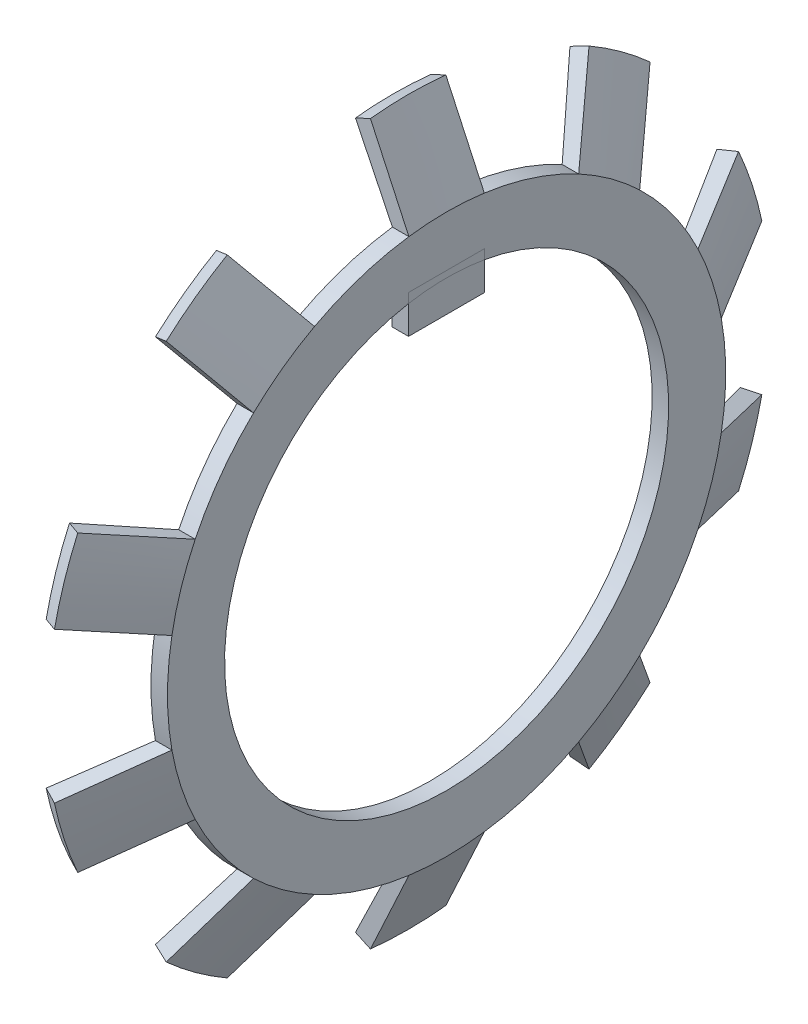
ISO-10303-21;
HEADER;
FILE_DESCRIPTION(('STEP AP214'),'2;1');
FILE_NAME('part.step','',(''),(''),'','','');
FILE_SCHEMA(('AUTOMOTIVE_DESIGN { 1 0 10303 214 1 1 1 1 }'));
ENDSEC;
DATA;
#1=APPLICATION_CONTEXT('core data for automotive mechanical design processes');
#2=APPLICATION_PROTOCOL_DEFINITION('international standard','automotive_design',2000,#1);
#3=PRODUCT_CONTEXT('',#1,'mechanical');
#4=PRODUCT('Part','Part','',(#3));
#5=PRODUCT_RELATED_PRODUCT_CATEGORY('part','',(#4));
#6=PRODUCT_DEFINITION_FORMATION('','',#4);
#7=PRODUCT_DEFINITION_CONTEXT('part definition',#1,'design');
#8=PRODUCT_DEFINITION('design','',#6,#7);
#9=PRODUCT_DEFINITION_SHAPE('','',#8);
#10=(LENGTH_UNIT() NAMED_UNIT(*) SI_UNIT(.MILLI.,.METRE.));
#11=(NAMED_UNIT(*) PLANE_ANGLE_UNIT() SI_UNIT($,.RADIAN.));
#12=(NAMED_UNIT(*) SI_UNIT($,.STERADIAN.) SOLID_ANGLE_UNIT());
#13=UNCERTAINTY_MEASURE_WITH_UNIT(LENGTH_MEASURE(1.E-05),#10,'distance_accuracy_value','');
#14=(GEOMETRIC_REPRESENTATION_CONTEXT(3) GLOBAL_UNCERTAINTY_ASSIGNED_CONTEXT((#13)) GLOBAL_UNIT_ASSIGNED_CONTEXT((#10,
#11,#12)) REPRESENTATION_CONTEXT('',''));
#15=CARTESIAN_POINT('',(0.,0.,0.));
#16=DIRECTION('',(0.,0.,1.));
#17=DIRECTION('',(1.,0.,0.));
#18=AXIS2_PLACEMENT_3D('',#15,#16,#17);
#19=CARTESIAN_POINT('',(6.66133814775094E-12,-1.33226762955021E-12,-9.99200722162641E-13));
#20=DIRECTION('',(-0.999999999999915,0.,0.));
#21=DIRECTION('',(0.,0.,1.00000000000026));
#22=AXIS2_PLACEMENT_3D('',#19,#20,#21);
#23=CONICAL_SURFACE('',#22,22.,1.13446401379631);
#24=CARTESIAN_POINT('',(6.66133814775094E-12,-1.33226762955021E-12,-9.99200722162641E-13));
#25=DIRECTION('',(0.999999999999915,0.,0.));
#26=DIRECTION('',(0.,0.,-1.00000000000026));
#27=AXIS2_PLACEMENT_3D('',#24,#25,#26);
#28=CIRCLE('',#27,22.);
#29=CARTESIAN_POINT('',(1.35447209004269E-11,19.3823518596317,10.4079025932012));
#30=VERTEX_POINT('',#29);
#31=CARTESIAN_POINT('',(-2.44249065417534E-12,15.8879796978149,15.2174932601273));
#32=VERTEX_POINT('',#31);
#33=EDGE_CURVE('E331',#30,#32,#28,.T.);
#34=ORIENTED_EDGE('',*,*,#33,.F.);
#35=CARTESIAN_POINT('',(1.14234066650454E-07,19.3823516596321,10.4079024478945));
#36=CARTESIAN_POINT('',(-0.252146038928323,19.8238544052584,10.7286729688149));
#37=CARTESIAN_POINT('',(-0.504429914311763,20.2653056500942,11.0494060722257));
#38=CARTESIAN_POINT('',(-1.00922864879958,21.1481216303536,11.6908094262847));
#39=CARTESIAN_POINT('',(-1.26174350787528,21.5894863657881,12.0114796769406));
#40=CARTESIAN_POINT('',(-1.76695980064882,22.4721459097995,12.652769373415));
#41=CARTESIAN_POINT('',(-2.01966123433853,22.9134407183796,12.9733888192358));
#42=CARTESIAN_POINT('',(-2.52522068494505,23.7959716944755,13.6145851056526));
#43=CARTESIAN_POINT('',(-2.77807870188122,24.2372078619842,13.9351619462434));
#44=CARTESIAN_POINT('',(-3.03099997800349,24.6784202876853,14.2557215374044));
#45=B_SPLINE_CURVE_WITH_KNOTS('',3,(#35,#36,#37,#38,#39,#40,#41,#42,#43,#44),.UNSPECIFIED.,.F.,
.F.,(4,2,2,2,4),(0.,1.80348678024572,3.60697333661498,5.41045981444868,7.21394651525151),.UNSPECIFIED.);
#46=CARTESIAN_POINT('',(-3.03099977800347,24.6784199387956,14.2557212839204));
#47=VERTEX_POINT('',#46);
#48=EDGE_CURVE('E311',#30,#47,#45,.T.);
#49=ORIENTED_EDGE('',*,*,#48,.T.);
#50=CARTESIAN_POINT('',(-3.03099977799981,-5.32907051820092E-12,-2.66453525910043E-12));
#51=DIRECTION('',(0.999999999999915,0.,0.));
#52=DIRECTION('',(0.,0.,-1.00000000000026));
#53=AXIS2_PLACEMENT_3D('',#50,#51,#52);
#54=CIRCLE('',#53,28.5);
#55=CARTESIAN_POINT('',(-3.03099977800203,21.1840477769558,19.0653119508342));
#56=VERTEX_POINT('',#55);
#57=EDGE_CURVE('E775',#47,#56,#54,.T.);
#58=ORIENTED_EDGE('',*,*,#57,.T.);
#59=CARTESIAN_POINT('',(1.14218190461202E-07,15.8879794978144,15.2174931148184));
#60=CARTESIAN_POINT('',(-0.252146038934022,16.3294822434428,15.53826363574));
#61=CARTESIAN_POINT('',(-0.50442991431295,16.7709334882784,15.8589967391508));
#62=CARTESIAN_POINT('',(-1.00922864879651,17.6537494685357,16.5004000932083));
#63=CARTESIAN_POINT('',(-1.26174350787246,18.0951142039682,16.8210703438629));
#64=CARTESIAN_POINT('',(-1.76695980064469,18.9777737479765,17.4623600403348));
#65=CARTESIAN_POINT('',(-2.01966123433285,19.4190685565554,17.7829794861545));
#66=CARTESIAN_POINT('',(-2.52522068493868,20.3015995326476,18.4241757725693));
#67=CARTESIAN_POINT('',(-2.77807870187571,20.7428357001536,18.7447526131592));
#68=CARTESIAN_POINT('',(-3.03099997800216,21.1840481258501,19.0653122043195));
#69=B_SPLINE_CURVE_WITH_KNOTS('',3,(#59,#60,#61,#62,#63,#64,#65,#66,#67,#68),.UNSPECIFIED.,.F.,
.F.,(4,2,2,2,4),(0.,1.80348678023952,3.60697333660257,5.41045981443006,7.21394651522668),.UNSPECIFIED.);
#70=EDGE_CURVE('E333',#32,#56,#69,.T.);
#71=ORIENTED_EDGE('',*,*,#70,.F.);
#72=EDGE_LOOP('',(#34,#49,#58,#71));
#73=FACE_BOUND('',#72,.T.);
#74=ADVANCED_FACE('F16',(#73),#23,.T.);
#75=CARTESIAN_POINT('',(-3.03099977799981,-5.32907051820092E-12,-2.66453525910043E-12));
#76=DIRECTION('',(0.999999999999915,0.,0.));
#77=DIRECTION('',(0.,0.,-1.00000000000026));
#78=AXIS2_PLACEMENT_3D('',#75,#76,#77);
#79=CONICAL_SURFACE('',#78,28.5,0.436332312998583);
#80=ORIENTED_EDGE('',*,*,#57,.F.);
#81=CARTESIAN_POINT('',(-3.03099957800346,24.6784200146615,14.2557213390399));
#82=CARTESIAN_POINT('',(-3.22737019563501,24.6039328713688,14.2016032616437));
#83=CARTESIAN_POINT('',(-3.42373888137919,24.5294423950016,14.1474827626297));
#84=CARTESIAN_POINT('',(-3.81647238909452,24.3804547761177,14.0392369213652));
#85=CARTESIAN_POINT('',(-4.01283721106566,24.3059576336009,13.9851115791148));
#86=CARTESIAN_POINT('',(-4.20920010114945,24.2314571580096,13.9309838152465));
#87=B_SPLINE_CURVE_WITH_KNOTS('',3,(#81,#82,#83,#84,#85,#86),.UNSPECIFIED.,.F.,.F.,(4,2,4),(0.,
0.650650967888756,1.30130193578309),.UNSPECIFIED.);
#88=CARTESIAN_POINT('',(-4.20919990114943,24.2314572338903,13.9309838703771));
#89=VERTEX_POINT('',#88);
#90=EDGE_CURVE('E316',#47,#89,#87,.T.);
#91=ORIENTED_EDGE('',*,*,#90,.T.);
#92=CARTESIAN_POINT('',(-4.20919990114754,-2.66453525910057E-12,-1.21014309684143E-11));
#93=DIRECTION('',(0.999999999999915,0.,0.));
#94=DIRECTION('',(0.,0.,-1.00000000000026));
#95=AXIS2_PLACEMENT_3D('',#92,#93,#94);
#96=CIRCLE('',#95,27.9505962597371);
#97=CARTESIAN_POINT('',(-4.20919990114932,20.7370850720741,18.7405745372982));
#98=VERTEX_POINT('',#97);
#99=EDGE_CURVE('E1033',#89,#98,#96,.T.);
#100=ORIENTED_EDGE('',*,*,#99,.T.);
#101=CARTESIAN_POINT('',(-3.03099957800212,21.1840478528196,19.0653120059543));
#102=CARTESIAN_POINT('',(-3.22737019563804,21.1095607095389,19.0111939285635));
#103=CARTESIAN_POINT('',(-3.42373888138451,21.0350702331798,18.9570734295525));
#104=CARTESIAN_POINT('',(-3.81647238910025,20.8860826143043,18.84882758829));
#105=CARTESIAN_POINT('',(-4.01283721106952,20.8115854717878,18.7947022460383));
#106=CARTESIAN_POINT('',(-4.20920010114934,20.737084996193,18.7405744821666));
#107=B_SPLINE_CURVE_WITH_KNOTS('',3,(#101,#102,#103,#104,#105,#106),.UNSPECIFIED.,.F.,.F.,(4,2,
4),(0.,0.650650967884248,1.30130193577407),.UNSPECIFIED.);
#108=EDGE_CURVE('E550',#56,#98,#107,.T.);
#109=ORIENTED_EDGE('',*,*,#108,.F.);
#110=EDGE_LOOP('',(#80,#91,#100,#109));
#111=FACE_BOUND('',#110,.T.);
#112=ADVANCED_FACE('F893',(#111),#79,.T.);
#113=CARTESIAN_POINT('',(-4.20919990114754,-2.66453525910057E-12,-1.21014309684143E-11));
#114=DIRECTION('',(-0.999999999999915,0.,0.));
#115=DIRECTION('',(0.,0.,1.00000000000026));
#116=AXIS2_PLACEMENT_3D('',#113,#114,#115);
#117=CONICAL_SURFACE('',#116,27.9505962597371,1.11607440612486);
#118=ORIENTED_EDGE('',*,*,#99,.F.);
#119=CARTESIAN_POINT('',(-4.20920010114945,24.2314575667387,13.9309841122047));
#120=CARTESIAN_POINT('',(-3.96646313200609,23.8274846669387,13.6374806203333));
#121=CARTESIAN_POINT('',(-3.7237843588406,23.4234888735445,13.3439604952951));
#122=CARTESIAN_POINT('',(-3.23856841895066,22.6154416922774,12.756879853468));
#123=CARTESIAN_POINT('',(-2.99603125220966,22.2113903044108,12.4633193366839));
#124=CARTESIAN_POINT('',(-2.51112367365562,21.4032220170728,11.8761507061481));
#125=CARTESIAN_POINT('',(-2.26875326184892,20.9991051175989,11.5825425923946));
#126=CARTESIAN_POINT('',(-1.78421534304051,20.1907916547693,10.9952684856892));
#127=CARTESIAN_POINT('',(-1.54204783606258,19.7865950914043,10.7016024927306));
#128=CARTESIAN_POINT('',(-1.29999988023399,19.3823516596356,10.4079024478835));
#129=B_SPLINE_CURVE_WITH_KNOTS('',3,(#119,#120,#121,#122,#123,#124,#125,#126,#127,#128),
.UNSPECIFIED.,.F.,.F.,(4,2,2,2,4),(0.,1.66563404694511,3.3312678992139,4.99690181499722,
6.6625359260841),.UNSPECIFIED.);
#130=CARTESIAN_POINT('',(-1.29999999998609,19.3823518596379,10.4079025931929));
#131=VERTEX_POINT('',#130);
#132=EDGE_CURVE('E328',#89,#131,#129,.T.);
#133=ORIENTED_EDGE('',*,*,#132,.T.);
#134=CARTESIAN_POINT('',(-1.29999999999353,1.37667655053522E-11,-8.65973959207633E-12));
#135=DIRECTION('',(0.999999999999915,0.,0.));
#136=DIRECTION('',(0.,0.,-1.00000000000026));
#137=AXIS2_PLACEMENT_3D('',#134,#135,#136);
#138=CIRCLE('',#137,22.);
#139=CARTESIAN_POINT('',(-1.30000000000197,15.8879796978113,15.2174932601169));
#140=VERTEX_POINT('',#139);
#141=EDGE_CURVE('E39',#131,#140,#138,.T.);
#142=ORIENTED_EDGE('',*,*,#141,.T.);
#143=CARTESIAN_POINT('',(-4.20920010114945,20.7370854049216,18.7405747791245));
#144=CARTESIAN_POINT('',(-3.96646313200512,20.333112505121,18.4470712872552));
#145=CARTESIAN_POINT('',(-3.72378435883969,19.9291167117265,18.1535511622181));
#146=CARTESIAN_POINT('',(-3.23856841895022,19.1210695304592,17.566470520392));
#147=CARTESIAN_POINT('',(-2.99603125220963,18.7170181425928,17.2729100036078));
#148=CARTESIAN_POINT('',(-2.51112367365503,17.9088498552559,16.6857413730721));
#149=CARTESIAN_POINT('',(-2.26875326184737,17.5047329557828,16.3921332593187));
#150=CARTESIAN_POINT('',(-1.78421534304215,16.6964194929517,15.8048591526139));
#151=CARTESIAN_POINT('',(-1.54204783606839,16.2922229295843,15.5111931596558));
#152=CARTESIAN_POINT('',(-1.29999988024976,15.8879794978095,15.2174931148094));
#153=B_SPLINE_CURVE_WITH_KNOTS('',3,(#143,#144,#145,#146,#147,#148,#149,#150,#151,#152),
.UNSPECIFIED.,.F.,.F.,(4,2,2,2,4),(0.,1.66563404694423,3.33126789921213,4.99690181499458,
6.66253592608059),.UNSPECIFIED.);
#154=EDGE_CURVE('E565',#98,#140,#153,.T.);
#155=ORIENTED_EDGE('',*,*,#154,.F.);
#156=EDGE_LOOP('',(#118,#133,#142,#155));
#157=FACE_BOUND('',#156,.T.);
#158=ADVANCED_FACE('F889',(#157),#117,.F.);
#159=CARTESIAN_POINT('',(5.32907051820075E-12,9.56304039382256,19.8128306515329));
#160=VERTEX_POINT('',#159);
#161=CARTESIAN_POINT('',(-8.88178419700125E-13,3.90902746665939,21.6499308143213));
#162=VERTEX_POINT('',#161);
#163=EDGE_CURVE('E338',#160,#162,#28,.T.);
#164=ORIENTED_EDGE('',*,*,#163,.F.);
#165=CARTESIAN_POINT('',(9.71676072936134E-08,9.56304032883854,19.8128304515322));
#166=CARTESIAN_POINT('',(-0.252146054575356,9.73167937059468,20.3318480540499));
#167=CARTESIAN_POINT('',(-0.504429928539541,9.90029874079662,20.8508051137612));
#168=CARTESIAN_POINT('',(-1.00922866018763,10.2375044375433,21.8886175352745));
#169=CARTESIAN_POINT('',(-1.26174351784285,10.4060907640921,22.4074728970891));
#170=CARTESIAN_POINT('',(-1.76695980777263,10.7432367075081,23.4451014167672));
#171=CARTESIAN_POINT('',(-2.01966124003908,10.9117963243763,23.9638745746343));
#172=CARTESIAN_POINT('',(-2.52522068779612,11.2488931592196,25.001351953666));
#173=CARTESIAN_POINT('',(-2.77807870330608,11.4174303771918,25.5200561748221));
#174=CARTESIAN_POINT('',(-3.0309999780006,11.5859585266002,26.0387324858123));
#175=B_SPLINE_CURVE_WITH_KNOTS('',3,(#165,#166,#167,#168,#169,#170,#171,#172,#173,#174),
.UNSPECIFIED.,.F.,.F.,(4,2,2,2,4),(0.,1.80348677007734,3.60697331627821,5.41045978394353,
7.21394647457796),.UNSPECIFIED.);
#176=CARTESIAN_POINT('',(-3.0309997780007,11.5859583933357,26.0387320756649));
#177=VERTEX_POINT('',#176);
#178=EDGE_CURVE('E535',#160,#177,#175,.T.);
#179=ORIENTED_EDGE('',*,*,#178,.T.);
#180=CARTESIAN_POINT('',(-3.03099977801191,5.93194546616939,27.8758322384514));
#181=VERTEX_POINT('',#180);
#182=EDGE_CURVE('E770',#177,#181,#54,.T.);
#183=ORIENTED_EDGE('',*,*,#182,.T.);
#184=CARTESIAN_POINT('',(9.71613900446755E-08,3.90902740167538,21.6499306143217));
#185=CARTESIAN_POINT('',(-0.252146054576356,4.07766644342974,22.1689482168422));
#186=CARTESIAN_POINT('',(-0.504429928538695,4.24628581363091,22.6879052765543));
#187=CARTESIAN_POINT('',(-1.00922866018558,4.58349151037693,23.7257176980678));
#188=CARTESIAN_POINT('',(-1.26174351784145,4.75207783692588,24.2445730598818));
#189=CARTESIAN_POINT('',(-1.76695980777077,5.08922378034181,25.2822015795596));
#190=CARTESIAN_POINT('',(-2.01966124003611,5.25778339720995,25.800974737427));
#191=CARTESIAN_POINT('',(-2.52522068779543,5.59488023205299,26.8384521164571));
#192=CARTESIAN_POINT('',(-2.77807870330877,5.76341745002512,27.3571563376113));
#193=CARTESIAN_POINT('',(-3.03099997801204,5.93194559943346,27.875832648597));
#194=B_SPLINE_CURVE_WITH_KNOTS('',3,(#184,#185,#186,#187,#188,#189,#190,#191,#192,#193),
.UNSPECIFIED.,.F.,.F.,(4,2,2,2,4),(0.,1.80348677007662,3.60697331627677,5.41045978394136,
7.21394647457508),.UNSPECIFIED.);
#195=EDGE_CURVE('E526',#162,#181,#194,.T.);
#196=ORIENTED_EDGE('',*,*,#195,.F.);
#197=EDGE_LOOP('',(#164,#179,#183,#196));
#198=FACE_BOUND('',#197,.T.);
#199=ADVANCED_FACE('F894',(#198),#23,.T.);
#200=ORIENTED_EDGE('',*,*,#182,.F.);
#201=CARTESIAN_POINT('',(-3.03099957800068,11.5859584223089,26.0387321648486));
#202=CARTESIAN_POINT('',(-3.22737019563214,11.557506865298,25.9511672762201));
#203=CARTESIAN_POINT('',(-3.42373888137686,11.5290540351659,25.8635984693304));
#204=CARTESIAN_POINT('',(-3.81647238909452,11.4721458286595,25.6884530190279));
#205=CARTESIAN_POINT('',(-4.01283721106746,11.4436904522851,25.6008763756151));
#206=CARTESIAN_POINT('',(-4.20920010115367,11.4152338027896,25.5132958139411));
#207=B_SPLINE_CURVE_WITH_KNOTS('',3,(#201,#202,#203,#204,#205,#206),.UNSPECIFIED.,.F.,.F.,(4,2,
4),(0.,0.650650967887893,1.30130193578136),.UNSPECIFIED.);
#208=CARTESIAN_POINT('',(-4.20919990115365,11.4152338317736,25.5132959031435));
#209=VERTEX_POINT('',#208);
#210=EDGE_CURVE('E573',#177,#209,#207,.T.);
#211=ORIENTED_EDGE('',*,*,#210,.T.);
#212=CARTESIAN_POINT('',(-4.20919990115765,5.76122090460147,27.3503960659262));
#213=VERTEX_POINT('',#212);
#214=EDGE_CURVE('E699',#209,#213,#96,.T.);
#215=ORIENTED_EDGE('',*,*,#214,.T.);
#216=CARTESIAN_POINT('',(-3.03099957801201,5.93194549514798,27.8758323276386));
#217=CARTESIAN_POINT('',(-3.22737019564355,5.90349393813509,27.7882674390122));
#218=CARTESIAN_POINT('',(-3.4237388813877,5.87504110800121,27.700698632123));
#219=CARTESIAN_POINT('',(-3.81647238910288,5.81813290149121,27.5255531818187));
#220=CARTESIAN_POINT('',(-4.01283721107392,5.78967752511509,27.4379765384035));
#221=CARTESIAN_POINT('',(-4.20920010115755,5.76122087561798,27.3503959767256));
#222=B_SPLINE_CURVE_WITH_KNOTS('',3,(#216,#217,#218,#219,#220,#221),.UNSPECIFIED.,.F.,.F.,(4,2,
4),(0.,0.650650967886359,1.30130193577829),.UNSPECIFIED.);
#223=EDGE_CURVE('E1313',#181,#213,#222,.T.);
#224=ORIENTED_EDGE('',*,*,#223,.F.);
#225=EDGE_LOOP('',(#200,#211,#215,#224));
#226=FACE_BOUND('',#225,.T.);
#227=ADVANCED_FACE('F899',(#226),#79,.T.);
#228=ORIENTED_EDGE('',*,*,#214,.F.);
#229=CARTESIAN_POINT('',(-4.20920010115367,11.4152339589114,25.5132962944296));
#230=CARTESIAN_POINT('',(-3.96646313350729,11.2609300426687,25.0383976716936));
#231=CARTESIAN_POINT('',(-3.72378436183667,11.1066173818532,24.5634721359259));
#232=CARTESIAN_POINT('',(-3.23856842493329,10.7979708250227,23.6135557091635));
#233=CARTESIAN_POINT('',(-2.99603125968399,10.6436369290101,23.1385648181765));
#234=CARTESIAN_POINT('',(-2.51112368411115,10.3349441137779,22.1885060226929));
#235=CARTESIAN_POINT('',(-2.26875327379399,10.1805851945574,21.7134381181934));
#236=CARTESIAN_POINT('',(-1.78421535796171,9.87183692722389,20.7632086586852));
#237=CARTESIAN_POINT('',(-1.5420478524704,9.71744757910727,20.2880471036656));
#238=CARTESIAN_POINT('',(-1.29999989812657,9.5630403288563,19.8128304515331));
#239=B_SPLINE_CURVE_WITH_KNOTS('',3,(#229,#230,#231,#232,#233,#234,#235,#236,#237,#238),
.UNSPECIFIED.,.F.,.F.,(4,2,2,2,4),(0.,1.66563403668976,3.3312678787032,4.99690178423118,
6.6625358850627),.UNSPECIFIED.);
#240=CARTESIAN_POINT('',(-1.29999999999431,9.56304039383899,19.8128306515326));
#241=VERTEX_POINT('',#240);
#242=EDGE_CURVE('E578',#209,#241,#239,.T.);
#243=ORIENTED_EDGE('',*,*,#242,.T.);
#244=CARTESIAN_POINT('',(-1.30000000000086,3.90902746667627,21.6499308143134));
#245=VERTEX_POINT('',#244);
#246=EDGE_CURVE('E618',#241,#245,#138,.T.);
#247=ORIENTED_EDGE('',*,*,#246,.T.);
#248=CARTESIAN_POINT('',(-4.20920010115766,5.76122103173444,27.35039645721));
#249=CARTESIAN_POINT('',(-3.96646313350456,5.60691711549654,26.8754978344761));
#250=CARTESIAN_POINT('',(-3.7237843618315,5.45260445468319,26.4005722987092));
#251=CARTESIAN_POINT('',(-3.23856842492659,5.14395789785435,25.4506558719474));
#252=CARTESIAN_POINT('',(-2.9960312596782,4.98962400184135,24.9756649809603));
#253=CARTESIAN_POINT('',(-2.51112368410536,4.68093118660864,24.0256061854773));
#254=CARTESIAN_POINT('',(-2.26875327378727,4.52657226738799,23.5505382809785));
#255=CARTESIAN_POINT('',(-1.78421535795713,4.21782400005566,22.6003088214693));
#256=CARTESIAN_POINT('',(-1.54204785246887,4.06343465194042,22.1251472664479));
#257=CARTESIAN_POINT('',(-1.29999989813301,3.90902740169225,21.6499306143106));
#258=B_SPLINE_CURVE_WITH_KNOTS('',3,(#248,#249,#250,#251,#252,#253,#254,#255,#256,#257),
.UNSPECIFIED.,.F.,.F.,(4,2,2,2,4),(0.,1.66563403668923,3.33126787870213,4.99690178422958,
6.66253588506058),.UNSPECIFIED.);
#259=EDGE_CURVE('E1304',#213,#245,#258,.T.);
#260=ORIENTED_EDGE('',*,*,#259,.F.);
#261=EDGE_LOOP('',(#228,#243,#247,#260));
#262=FACE_BOUND('',#261,.T.);
#263=ADVANCED_FACE('F697',(#262),#117,.F.);
#264=CARTESIAN_POINT('',(7.7715611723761E-12,-3.90902746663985,21.6499308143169));
#265=VERTEX_POINT('',#264);
#266=CARTESIAN_POINT('',(6.66133814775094E-12,-9.56304039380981,19.8128306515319));
#267=VERTEX_POINT('',#266);
#268=EDGE_CURVE('E1237',#265,#267,#28,.T.);
#269=ORIENTED_EDGE('',*,*,#268,.F.);
#270=CARTESIAN_POINT('',(9.71691616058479E-08,-3.90902740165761,21.6499306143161));
#271=CARTESIAN_POINT('',(-0.252146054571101,-4.07766644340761,22.1689482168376));
#272=CARTESIAN_POINT('',(-0.504429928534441,-4.24628581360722,22.6879052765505));
#273=CARTESIAN_POINT('',(-1.00922866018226,-4.58349151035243,23.7257176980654));
#274=CARTESIAN_POINT('',(-1.26174351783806,-4.75207783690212,24.24457305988));
#275=CARTESIAN_POINT('',(-1.76695980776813,-5.08922378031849,25.2822015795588));
#276=CARTESIAN_POINT('',(-2.01966124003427,-5.25778339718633,25.8009747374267));
#277=CARTESIAN_POINT('',(-2.52522068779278,-5.59488023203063,26.8384521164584));
#278=CARTESIAN_POINT('',(-2.7780787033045,-5.76341745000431,27.3571563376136));
#279=CARTESIAN_POINT('',(-3.03099997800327,-5.93194559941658,27.875832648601));
#280=B_SPLINE_CURVE_WITH_KNOTS('',3,(#270,#271,#272,#273,#274,#275,#276,#277,#278,#279),
.UNSPECIFIED.,.F.,.F.,(4,2,2,2,4),(0.,1.80348677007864,3.60697331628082,5.41045978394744,
7.21394647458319),.UNSPECIFIED.);
#281=CARTESIAN_POINT('',(-3.03099977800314,-5.9319454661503,27.8758322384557));
#282=VERTEX_POINT('',#281);
#283=EDGE_CURVE('E517',#265,#282,#280,.T.);
#284=ORIENTED_EDGE('',*,*,#283,.T.);
#285=CARTESIAN_POINT('',(-3.03099977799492,-11.5859583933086,26.0387320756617));
#286=VERTEX_POINT('',#285);
#287=EDGE_CURVE('E767',#282,#286,#54,.T.);
#288=ORIENTED_EDGE('',*,*,#287,.T.);
#289=CARTESIAN_POINT('',(9.7168939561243E-08,-9.56304032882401,19.812830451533));
#290=CARTESIAN_POINT('',(-0.252146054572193,-9.73167937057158,20.3318480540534));
#291=CARTESIAN_POINT('',(-0.504429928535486,-9.90029874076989,20.8508051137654));
#292=CARTESIAN_POINT('',(-1.00922866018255,-10.2375044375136,21.8886175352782));
#293=CARTESIAN_POINT('',(-1.26174351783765,-10.4060907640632,22.4074728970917));
#294=CARTESIAN_POINT('',(-1.76695980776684,-10.7432367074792,23.4451014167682));
#295=CARTESIAN_POINT('',(-2.0196612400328,-10.9117963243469,23.9638745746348));
#296=CARTESIAN_POINT('',(-2.52522068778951,-11.2488931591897,25.0013519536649));
#297=CARTESIAN_POINT('',(-2.7780787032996,-11.417430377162,25.5200561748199));
#298=CARTESIAN_POINT('',(-3.03099997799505,-11.5859585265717,26.0387324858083));
#299=B_SPLINE_CURVE_WITH_KNOTS('',3,(#289,#290,#291,#292,#293,#294,#295,#296,#297,#298),
.UNSPECIFIED.,.F.,.F.,(4,2,2,2,4),(0.,1.80348677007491,3.60697331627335,5.41045978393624,
7.21394647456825),.UNSPECIFIED.);
#300=EDGE_CURVE('E508',#267,#286,#299,.T.);
#301=ORIENTED_EDGE('',*,*,#300,.F.);
#302=EDGE_LOOP('',(#269,#284,#288,#301));
#303=FACE_BOUND('',#302,.T.);
#304=ADVANCED_FACE('F901',(#303),#23,.T.);
#305=ORIENTED_EDGE('',*,*,#287,.F.);
#306=CARTESIAN_POINT('',(-3.03099957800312,-5.93194549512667,27.875832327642));
#307=CARTESIAN_POINT('',(-3.22737019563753,-5.90349393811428,27.7882674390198));
#308=CARTESIAN_POINT('',(-3.42373888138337,-5.87504110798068,27.7006986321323));
#309=CARTESIAN_POINT('',(-3.81647238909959,-5.81813290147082,27.5255531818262));
#310=CARTESIAN_POINT('',(-4.01283721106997,-5.78967752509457,27.4379765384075));
#311=CARTESIAN_POINT('',(-4.20920010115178,-5.76122087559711,27.3503959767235));
#312=B_SPLINE_CURVE_WITH_KNOTS('',3,(#306,#307,#308,#309,#310,#311),.UNSPECIFIED.,.F.,.F.,(4,2,
4),(0.,0.650650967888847,1.30130193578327),.UNSPECIFIED.);
#313=CARTESIAN_POINT('',(-4.20919990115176,-5.76122090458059,27.3503960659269));
#314=VERTEX_POINT('',#313);
#315=EDGE_CURVE('E1298',#282,#314,#312,.T.);
#316=ORIENTED_EDGE('',*,*,#315,.T.);
#317=CARTESIAN_POINT('',(-4.20919990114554,-11.4152338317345,25.5132959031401));
#318=VERTEX_POINT('',#317);
#319=EDGE_CURVE('E1039',#314,#318,#96,.T.);
#320=ORIENTED_EDGE('',*,*,#319,.T.);
#321=CARTESIAN_POINT('',(-3.03099957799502,-11.5859584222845,26.0387321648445));
#322=CARTESIAN_POINT('',(-3.22737019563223,-11.5575068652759,25.9511672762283));
#323=CARTESIAN_POINT('',(-3.42373888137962,-11.5290540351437,25.8635984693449));
#324=CARTESIAN_POINT('',(-3.81647238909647,-11.4721458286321,25.6884530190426));
#325=CARTESIAN_POINT('',(-4.01283721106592,-11.4436904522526,25.6008763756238));
#326=CARTESIAN_POINT('',(-4.20920010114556,-11.4152338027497,25.5132958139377));
#327=B_SPLINE_CURVE_WITH_KNOTS('',3,(#321,#322,#323,#324,#325,#326),.UNSPECIFIED.,.F.,.F.,(4,2,
4),(0.,0.650650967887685,1.30130193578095),.UNSPECIFIED.);
#328=EDGE_CURVE('E746',#286,#318,#327,.T.);
#329=ORIENTED_EDGE('',*,*,#328,.F.);
#330=EDGE_LOOP('',(#305,#316,#320,#329));
#331=FACE_BOUND('',#330,.T.);
#332=ADVANCED_FACE('F906',(#331),#79,.T.);
#333=ORIENTED_EDGE('',*,*,#319,.F.);
#334=CARTESIAN_POINT('',(-4.20920010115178,-5.76122103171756,27.3503964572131));
#335=CARTESIAN_POINT('',(-3.96646313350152,-5.60691711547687,26.8754978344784));
#336=CARTESIAN_POINT('',(-3.72378436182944,-5.45260445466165,26.4005722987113));
#337=CARTESIAN_POINT('',(-3.23856842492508,-5.1439578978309,25.4506558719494));
#338=CARTESIAN_POINT('',(-2.99603125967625,-4.98962400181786,24.9756649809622));
#339=CARTESIAN_POINT('',(-2.51112368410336,-4.68093118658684,24.0256061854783));
#340=CARTESIAN_POINT('',(-2.26875327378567,-4.52657226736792,23.5505382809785));
#341=CARTESIAN_POINT('',(-1.78421535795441,-4.21782400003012,22.6003088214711));
#342=CARTESIAN_POINT('',(-1.54204785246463,-4.06343465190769,22.1251472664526));
#343=CARTESIAN_POINT('',(-1.2999998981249,-3.90902740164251,21.6499306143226));
#344=B_SPLINE_CURVE_WITH_KNOTS('',3,(#334,#335,#336,#337,#338,#339,#340,#341,#342,#343),
.UNSPECIFIED.,.F.,.F.,(4,2,2,2,4),(0.,1.66563403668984,3.33126787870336,4.99690178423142,
6.66253588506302),.UNSPECIFIED.);
#345=CARTESIAN_POINT('',(-1.29999999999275,-3.90902746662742,21.6499308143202));
#346=VERTEX_POINT('',#345);
#347=EDGE_CURVE('E1293',#314,#346,#344,.T.);
#348=ORIENTED_EDGE('',*,*,#347,.T.);
#349=CARTESIAN_POINT('',(-1.2999999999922,-9.56304039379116,19.8128306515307));
#350=VERTEX_POINT('',#349);
#351=EDGE_CURVE('E679',#346,#350,#138,.T.);
#352=ORIENTED_EDGE('',*,*,#351,.T.);
#353=CARTESIAN_POINT('',(-4.20920010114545,-11.4152339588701,25.513296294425));
#354=CARTESIAN_POINT('',(-3.96646313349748,-11.260930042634,25.0383976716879));
#355=CARTESIAN_POINT('',(-3.72378436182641,-11.1066173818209,24.5634721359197));
#356=CARTESIAN_POINT('',(-3.23856842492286,-10.7979708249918,23.6135557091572));
#357=CARTESIAN_POINT('',(-2.99603125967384,-10.6436369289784,23.1385648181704));
#358=CARTESIAN_POINT('',(-2.51112368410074,-10.3349441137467,22.188506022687));
#359=CARTESIAN_POINT('',(-2.26875327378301,-10.1805851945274,21.7134381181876));
#360=CARTESIAN_POINT('',(-1.78421535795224,-9.8718369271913,20.7632086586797));
#361=CARTESIAN_POINT('',(-1.54204785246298,-9.71744757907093,20.2880471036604));
#362=CARTESIAN_POINT('',(-1.29999989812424,-9.56304032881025,19.8128304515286));
#363=B_SPLINE_CURVE_WITH_KNOTS('',3,(#353,#354,#355,#356,#357,#358,#359,#360,#361,#362),
.UNSPECIFIED.,.F.,.F.,(4,2,2,2,4),(0.,1.66563403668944,3.33126787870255,4.99690178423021,
6.66253588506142),.UNSPECIFIED.);
#364=EDGE_CURVE('E742',#318,#350,#363,.T.);
#365=ORIENTED_EDGE('',*,*,#364,.F.);
#366=EDGE_LOOP('',(#333,#348,#352,#365));
#367=FACE_BOUND('',#366,.T.);
#368=ADVANCED_FACE('F913',(#367),#117,.F.);
#369=CARTESIAN_POINT('',(3.66373598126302E-12,-15.8879796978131,15.2174932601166));
#370=VERTEX_POINT('',#369);
#371=CARTESIAN_POINT('',(4.32986979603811E-12,-19.3823518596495,10.4079025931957));
#372=VERTEX_POINT('',#371);
#373=EDGE_CURVE('E760',#370,#372,#28,.T.);
#374=ORIENTED_EDGE('',*,*,#373,.F.);
#375=CARTESIAN_POINT('',(1.14224296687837E-07,-15.8879794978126,15.2174931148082));
#376=CARTESIAN_POINT('',(-0.252146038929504,-16.3294822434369,15.5382636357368));
#377=CARTESIAN_POINT('',(-0.504429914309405,-16.7709334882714,15.8589967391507));
#378=CARTESIAN_POINT('',(-1.00922864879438,-17.6537494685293,16.5004000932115));
#379=CARTESIAN_POINT('',(-1.26174350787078,-18.0951142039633,16.8210703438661));
#380=CARTESIAN_POINT('',(-1.76695980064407,-18.977773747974,17.4623600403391));
#381=CARTESIAN_POINT('',(-2.01966123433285,-19.4190685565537,17.7829794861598));
#382=CARTESIAN_POINT('',(-2.52522068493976,-20.301599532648,18.4241757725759));
#383=CARTESIAN_POINT('',(-2.77807870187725,-20.7428357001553,18.7447526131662));
#384=CARTESIAN_POINT('',(-3.03099997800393,-21.1840481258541,19.0653122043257));
#385=B_SPLINE_CURVE_WITH_KNOTS('',3,(#375,#376,#377,#378,#379,#380,#381,#382,#383,#384),
.UNSPECIFIED.,.F.,.F.,(4,2,2,2,4),(0.,1.80348678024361,3.60697333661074,5.41045981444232,
7.21394651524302),.UNSPECIFIED.);
#386=CARTESIAN_POINT('',(-3.03099977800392,-21.184047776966,19.0653119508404));
#387=VERTEX_POINT('',#386);
#388=EDGE_CURVE('E499',#370,#387,#385,.T.);
#389=ORIENTED_EDGE('',*,*,#388,.T.);
#390=CARTESIAN_POINT('',(-3.03099977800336,-24.678419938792,14.2557212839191));
#391=VERTEX_POINT('',#390);
#392=EDGE_CURVE('E758',#387,#391,#54,.T.);
#393=ORIENTED_EDGE('',*,*,#392,.T.);
#394=CARTESIAN_POINT('',(1.14224962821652E-07,-19.3823516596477,10.4079024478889));
#395=CARTESIAN_POINT('',(-0.252146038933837,-19.8238544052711,10.7286729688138));
#396=CARTESIAN_POINT('',(-0.504429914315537,-20.265305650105,11.0494060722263));
#397=CARTESIAN_POINT('',(-1.00922864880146,-21.148121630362,11.6908094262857));
#398=CARTESIAN_POINT('',(-1.261743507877,-21.5894863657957,12.0114796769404));
#399=CARTESIAN_POINT('',(-1.7669598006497,-22.4721459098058,12.652769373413));
#400=CARTESIAN_POINT('',(-2.01966123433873,-22.9134407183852,12.9733888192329));
#401=CARTESIAN_POINT('',(-2.5252206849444,-23.7959716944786,13.6145851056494));
#402=CARTESIAN_POINT('',(-2.77807870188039,-24.2372078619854,13.9351619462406));
#403=CARTESIAN_POINT('',(-3.03099997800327,-24.6784202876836,14.2557215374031));
#404=B_SPLINE_CURVE_WITH_KNOTS('',3,(#394,#395,#396,#397,#398,#399,#400,#401,#402,#403),
.UNSPECIFIED.,.F.,.F.,(4,2,2,2,4),(0.,1.80348678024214,3.60697333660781,5.41045981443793,
7.21394651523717),.UNSPECIFIED.);
#405=EDGE_CURVE('E490',#372,#391,#404,.T.);
#406=ORIENTED_EDGE('',*,*,#405,.F.);
#407=EDGE_LOOP('',(#374,#389,#393,#406));
#408=FACE_BOUND('',#407,.T.);
#409=ADVANCED_FACE('F756',(#408),#23,.T.);
#410=ORIENTED_EDGE('',*,*,#392,.F.);
#411=CARTESIAN_POINT('',(-3.03099957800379,-21.1840478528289,19.0653120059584));
#412=CARTESIAN_POINT('',(-3.22737019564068,-21.1095607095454,19.0111939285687));
#413=CARTESIAN_POINT('',(-3.42373888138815,-21.0350702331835,18.9570734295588));
#414=CARTESIAN_POINT('',(-3.81647238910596,-20.8860826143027,18.8488275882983));
#415=CARTESIAN_POINT('',(-4.0128372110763,-20.8115854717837,18.7947022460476));
#416=CARTESIAN_POINT('',(-4.20920010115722,-20.7370849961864,18.7405744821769));
#417=B_SPLINE_CURVE_WITH_KNOTS('',3,(#411,#412,#413,#414,#415,#416),.UNSPECIFIED.,.F.,.F.,(4,2,
4),(0.,0.650650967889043,1.30130193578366),.UNSPECIFIED.);
#418=CARTESIAN_POINT('',(-4.2091999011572,-20.737085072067,18.7405745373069));
#419=VERTEX_POINT('',#418);
#420=EDGE_CURVE('E720',#387,#419,#417,.T.);
#421=ORIENTED_EDGE('',*,*,#420,.T.);
#422=CARTESIAN_POINT('',(-4.20919990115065,-24.2314572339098,13.9309838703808));
#423=VERTEX_POINT('',#422);
#424=EDGE_CURVE('E719',#419,#423,#96,.T.);
#425=ORIENTED_EDGE('',*,*,#424,.T.);
#426=CARTESIAN_POINT('',(-3.03099957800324,-24.6784200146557,14.2557213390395));
#427=CARTESIAN_POINT('',(-3.22737019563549,-24.6039328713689,14.2016032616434));
#428=CARTESIAN_POINT('',(-3.42373888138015,-24.5294423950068,14.1474827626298));
#429=CARTESIAN_POINT('',(-3.81647238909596,-24.3804547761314,14.0392369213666));
#430=CARTESIAN_POINT('',(-4.01283721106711,-24.3059576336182,13.985111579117));
#431=CARTESIAN_POINT('',(-4.20920010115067,-24.2314571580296,13.9309838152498));
#432=B_SPLINE_CURVE_WITH_KNOTS('',3,(#426,#427,#428,#429,#430,#431),.UNSPECIFIED.,.F.,.F.,(4,2,
4),(0.,0.65065096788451,1.30130193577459),.UNSPECIFIED.);
#433=EDGE_CURVE('E766',#391,#423,#432,.T.);
#434=ORIENTED_EDGE('',*,*,#433,.F.);
#435=EDGE_LOOP('',(#410,#421,#425,#434));
#436=FACE_BOUND('',#435,.T.);
#437=ADVANCED_FACE('F764',(#436),#79,.T.);
#438=ORIENTED_EDGE('',*,*,#424,.F.);
#439=CARTESIAN_POINT('',(-4.20920010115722,-20.7370854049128,18.7405747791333));
#440=CARTESIAN_POINT('',(-3.96646313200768,-20.333112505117,18.4470712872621));
#441=CARTESIAN_POINT('',(-3.72378435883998,-19.9291167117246,18.1535511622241));
#442=CARTESIAN_POINT('',(-3.23856841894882,-19.1210695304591,17.5664705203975));
#443=CARTESIAN_POINT('',(-2.99603125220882,-18.7170181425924,17.2729100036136));
#444=CARTESIAN_POINT('',(-2.51112367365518,-17.908849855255,16.6857413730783));
#445=CARTESIAN_POINT('',(-2.26875326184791,-17.5047329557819,16.3921332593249));
#446=CARTESIAN_POINT('',(-1.78421534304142,-16.6964194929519,15.8048591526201));
#447=CARTESIAN_POINT('',(-1.542047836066,-16.2922229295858,15.5111931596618));
#448=CARTESIAN_POINT('',(-1.29999988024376,-15.8879794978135,15.2174931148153));
#449=B_SPLINE_CURVE_WITH_KNOTS('',3,(#439,#440,#441,#442,#443,#444,#445,#446,#447,#448),
.UNSPECIFIED.,.F.,.F.,(4,2,2,2,4),(0.,1.66563404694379,3.33126789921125,4.99690181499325,
6.6625359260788),.UNSPECIFIED.);
#450=CARTESIAN_POINT('',(-1.29999999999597,-15.8879796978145,15.2174932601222));
#451=VERTEX_POINT('',#450);
#452=EDGE_CURVE('E713',#419,#451,#449,.T.);
#453=ORIENTED_EDGE('',*,*,#452,.T.);
#454=CARTESIAN_POINT('',(-1.29999999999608,-19.3823518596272,10.4079025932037));
#455=VERTEX_POINT('',#454);
#456=EDGE_CURVE('E668',#451,#455,#138,.T.);
#457=ORIENTED_EDGE('',*,*,#456,.T.);
#458=CARTESIAN_POINT('',(-4.20920010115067,-24.2314575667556,13.9309841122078));
#459=CARTESIAN_POINT('',(-3.96646313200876,-23.8274846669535,13.6374806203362));
#460=CARTESIAN_POINT('',(-3.72378435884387,-23.4234888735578,13.3439604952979));
#461=CARTESIAN_POINT('',(-3.23856841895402,-22.6154416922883,12.7568798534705));
#462=CARTESIAN_POINT('',(-2.99603125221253,-22.2113903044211,12.463319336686));
#463=CARTESIAN_POINT('',(-2.51112367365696,-21.4032220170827,11.8761507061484));
#464=CARTESIAN_POINT('',(-2.26875326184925,-20.999105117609,11.5825425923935));
#465=CARTESIAN_POINT('',(-1.78421534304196,-20.1907916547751,10.9952684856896));
#466=CARTESIAN_POINT('',(-1.54204783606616,-19.7865950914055,10.7016024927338));
#467=CARTESIAN_POINT('',(-1.2999998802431,-19.3823516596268,10.4079024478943));
#468=B_SPLINE_CURVE_WITH_KNOTS('',3,(#458,#459,#460,#461,#462,#463,#464,#465,#466,#467),
.UNSPECIFIED.,.F.,.F.,(4,2,2,2,4),(0.,1.66563404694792,3.33126789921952,4.99690181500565,
6.66253592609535),.UNSPECIFIED.);
#469=EDGE_CURVE('E1197',#423,#455,#468,.T.);
#470=ORIENTED_EDGE('',*,*,#469,.F.);
#471=EDGE_LOOP('',(#438,#453,#457,#470));
#472=FACE_BOUND('',#471,.T.);
#473=ADVANCED_FACE('F718',(#472),#117,.F.);
#474=CARTESIAN_POINT('',(3.33066907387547E-13,-21.7982636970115,2.97249050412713));
#475=VERTEX_POINT('',#474);
#476=CARTESIAN_POINT('',(7.54951656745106E-12,-21.7982636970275,-2.97249050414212));
#477=VERTEX_POINT('',#476);
#478=EDGE_CURVE('E1235',#475,#477,#28,.T.);
#479=ORIENTED_EDGE('',*,*,#478,.F.);
#480=CARTESIAN_POINT('',(3.51697781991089,-14.1489492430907,2.97249050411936));
#481=CARTESIAN_POINT('',(3.26275485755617,-14.7059869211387,2.97249050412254));
#482=CARTESIAN_POINT('',(3.00804309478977,-15.2628011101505,2.97249050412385));
#483=CARTESIAN_POINT('',(2.49785276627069,-16.37607765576,2.9724905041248));
#484=CARTESIAN_POINT('',(2.24237420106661,-16.9325400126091,2.97249050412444));
#485=CARTESIAN_POINT('',(1.73086113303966,-18.0452078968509,2.97249050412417));
#486=CARTESIAN_POINT('',(1.47482663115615,-18.6014134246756,2.97249050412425));
#487=CARTESIAN_POINT('',(0.962326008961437,-19.7136257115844,2.97249050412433));
#488=CARTESIAN_POINT('',(0.70585988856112,-20.2696324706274,2.97249050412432));
#489=CARTESIAN_POINT('',(-0.06403633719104,-21.9374195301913,2.97249050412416));
#490=CARTESIAN_POINT('',(-0.57796558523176,-23.0489693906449,2.97249050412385));
#491=CARTESIAN_POINT('',(-1.60667728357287,-25.2716747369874,2.97249050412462));
#492=CARTESIAN_POINT('',(-2.12145973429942,-26.382830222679,2.97249050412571));
#493=CARTESIAN_POINT('',(-3.15160934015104,-28.6048664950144,2.97249050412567));
#494=CARTESIAN_POINT('',(-3.66697649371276,-29.7157472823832,2.97249050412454));
#495=CARTESIAN_POINT('',(-4.69812838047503,-31.9373147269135,2.97249050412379));
#496=CARTESIAN_POINT('',(-5.21391311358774,-33.0480013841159,2.97249050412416));
#497=CARTESIAN_POINT('',(-6.24579090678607,-35.2692342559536,2.97249050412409));
#498=CARTESIAN_POINT('',(-6.76188396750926,-36.3797804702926,2.97249050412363));
#499=CARTESIAN_POINT('',(-7.7943075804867,-38.6007624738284,2.97249050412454));
#500=CARTESIAN_POINT('',(-8.31063813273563,-39.7111982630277,2.97249050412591));
#501=CARTESIAN_POINT('',(-8.82705255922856,-40.8215950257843,2.9724905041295));
#502=B_SPLINE_CURVE_WITH_KNOTS('',3,(#480,#481,#482,#483,#484,#485,#486,#487,#488,#489,#490,
#491,#492,#493,#494,#495,#496,#497,#498,#499,#500,#501),.UNSPECIFIED.,.F.,.F.,(4,2,2,2,2,2,2,2,
2,2,4),(0.,1.83692127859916,3.67384124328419,5.51075810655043,7.34767534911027,11.0215006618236,
14.695327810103,18.3691451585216,22.0429617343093,25.7167859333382,29.3906100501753),.UNSPECIFIED.);
#503=CARTESIAN_POINT('',(-3.03099977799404,-28.3445638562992,2.9724905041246));
#504=VERTEX_POINT('',#503);
#505=EDGE_CURVE('E481',#475,#504,#502,.T.);
#506=ORIENTED_EDGE('',*,*,#505,.T.);
#507=CARTESIAN_POINT('',(-3.03099977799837,-28.3445638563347,-2.97249050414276));
#508=VERTEX_POINT('',#507);
#509=EDGE_CURVE('E768',#504,#508,#54,.T.);
#510=ORIENTED_EDGE('',*,*,#509,.T.);
#511=CARTESIAN_POINT('',(3.516977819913,-14.1489492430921,-2.97249050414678));
#512=CARTESIAN_POINT('',(3.26275485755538,-14.7059869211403,-2.97249050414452));
#513=CARTESIAN_POINT('',(3.00804309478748,-15.262801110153,-2.97249050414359));
#514=CARTESIAN_POINT('',(2.49785276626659,-16.3760776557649,-2.97249050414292));
#515=CARTESIAN_POINT('',(2.24237420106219,-16.9325400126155,-2.97249050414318));
#516=CARTESIAN_POINT('',(1.73086113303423,-18.04520789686,-2.97249050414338));
#517=CARTESIAN_POINT('',(1.47482663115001,-18.601413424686,-2.97249050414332));
#518=CARTESIAN_POINT('',(0.962326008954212,-19.7136257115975,-2.97249050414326));
#519=CARTESIAN_POINT('',(0.705859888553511,-20.269632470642,-2.97249050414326));
#520=CARTESIAN_POINT('',(-0.0640363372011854,-21.9374195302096,-2.97249050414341));
#521=CARTESIAN_POINT('',(-0.577965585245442,-23.0489693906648,-2.9724905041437));
#522=CARTESIAN_POINT('',(-1.60667728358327,-25.2716747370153,-2.97249050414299));
#523=CARTESIAN_POINT('',(-2.121459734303,-26.3828302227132,-2.97249050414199));
#524=CARTESIAN_POINT('',(-3.15160934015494,-28.6048664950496,-2.97249050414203));
#525=CARTESIAN_POINT('',(-3.66697649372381,-29.7157472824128,-2.97249050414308));
#526=CARTESIAN_POINT('',(-4.69812838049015,-31.9373147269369,-2.97249050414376));
#527=CARTESIAN_POINT('',(-5.21391311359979,-33.0480013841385,-2.9724905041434));
#528=CARTESIAN_POINT('',(-6.24579090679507,-35.2692342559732,-2.97249050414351));
#529=CARTESIAN_POINT('',(-6.76188396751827,-36.37978047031,-2.97249050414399));
#530=CARTESIAN_POINT('',(-7.79430758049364,-38.6007624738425,-2.97249050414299));
#531=CARTESIAN_POINT('',(-8.31063813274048,-39.7111982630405,-2.9724905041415));
#532=CARTESIAN_POINT('',(-8.82705255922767,-40.8215950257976,-2.97249050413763));
#533=B_SPLINE_CURVE_WITH_KNOTS('',3,(#511,#512,#513,#514,#515,#516,#517,#518,#519,#520,#521,
#522,#523,#524,#525,#526,#527,#528,#529,#530,#531,#532),.UNSPECIFIED.,.F.,.F.,(4,2,2,2,2,2,2,2,
2,2,4),(0.,1.83692127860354,3.67384124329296,5.51075810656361,7.34767534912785,11.0215006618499,
14.6953278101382,18.3691451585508,22.0429617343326,25.7167859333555,29.3906100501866),.UNSPECIFIED.);
#534=EDGE_CURVE('E472',#477,#508,#533,.T.);
#535=ORIENTED_EDGE('',*,*,#534,.F.);
#536=EDGE_LOOP('',(#479,#506,#510,#535));
#537=FACE_BOUND('',#536,.T.);
#538=ADVANCED_FACE('F917',(#537),#23,.T.);
#539=ORIENTED_EDGE('',*,*,#509,.F.);
#540=CARTESIAN_POINT('',(7.60673134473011,-33.3281619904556,2.97249050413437));
#541=CARTESIAN_POINT('',(5.7093221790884,-32.4398642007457,2.97249050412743));
#542=CARTESIAN_POINT('',(3.81201345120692,-31.5513517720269,2.97249050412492));
#543=CARTESIAN_POINT('',(0.0176749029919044,-29.7737325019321,2.97249050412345));
#544=CARTESIAN_POINT('',(-1.87935491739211,-28.8846256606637,2.97249050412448));
#545=CARTESIAN_POINT('',(-5.67305848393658,-27.1056520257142,2.97249050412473));
#546=CARTESIAN_POINT('',(-7.56973223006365,-26.2157852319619,2.97249050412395));
#547=CARTESIAN_POINT('',(-11.3625835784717,-24.4349940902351,2.97249050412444));
#548=CARTESIAN_POINT('',(-13.2587611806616,-23.5440697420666,2.97249050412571));
#549=CARTESIAN_POINT('',(-15.1546204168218,-22.6524679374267,2.97249050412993));
#550=B_SPLINE_CURVE_WITH_KNOTS('',3,(#540,#541,#542,#543,#544,#545,#546,#547,#548,#549),
.UNSPECIFIED.,.F.,.F.,(4,2,2,2,4),(0.,6.2851500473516,12.570298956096,18.8554484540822,
25.1405991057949),.UNSPECIFIED.);
#551=CARTESIAN_POINT('',(-4.20919990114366,-27.7920875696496,2.97249050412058));
#552=VERTEX_POINT('',#551);
#553=EDGE_CURVE('E1222',#504,#552,#550,.T.);
#554=ORIENTED_EDGE('',*,*,#553,.T.);
#555=CARTESIAN_POINT('',(-4.20919990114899,-27.7920875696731,-2.97249050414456));
#556=VERTEX_POINT('',#555);
#557=EDGE_CURVE('E1044',#552,#556,#96,.T.);
#558=ORIENTED_EDGE('',*,*,#557,.T.);
#559=CARTESIAN_POINT('',(7.606731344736,-33.3281619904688,-2.97249050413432));
#560=CARTESIAN_POINT('',(5.70932217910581,-32.4398642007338,-2.97249050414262));
#561=CARTESIAN_POINT('',(3.81201345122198,-31.5513517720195,-2.97249050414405));
#562=CARTESIAN_POINT('',(0.0176749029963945,-29.773732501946,-2.97249050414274));
#563=CARTESIAN_POINT('',(-1.87935491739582,-28.8846256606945,-2.97249050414));
#564=CARTESIAN_POINT('',(-5.67305848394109,-27.1056520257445,-2.97249050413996));
#565=CARTESIAN_POINT('',(-7.56973223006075,-26.2157852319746,-2.97249050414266));
#566=CARTESIAN_POINT('',(-11.3625835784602,-24.4349940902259,-2.97249050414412));
#567=CARTESIAN_POINT('',(-13.2587611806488,-23.5440697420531,-2.97249050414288));
#568=CARTESIAN_POINT('',(-15.1546204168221,-22.6524679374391,-2.97249050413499));
#569=B_SPLINE_CURVE_WITH_KNOTS('',3,(#559,#560,#561,#562,#563,#564,#565,#566,#567,#568),
.UNSPECIFIED.,.F.,.F.,(4,2,2,2,4),(0.,6.28515004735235,12.5702989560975,18.8554484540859,
25.1405991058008),.UNSPECIFIED.);
#570=EDGE_CURVE('E1151',#508,#556,#569,.T.);
#571=ORIENTED_EDGE('',*,*,#570,.F.);
#572=EDGE_LOOP('',(#539,#554,#558,#571));
#573=FACE_BOUND('',#572,.T.);
#574=ADVANCED_FACE('F922',(#573),#79,.T.);
#575=ORIENTED_EDGE('',*,*,#557,.F.);
#576=CARTESIAN_POINT('',(-9.76741524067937,-39.2070784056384,2.97249050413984));
#577=CARTESIAN_POINT('',(-8.77688728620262,-37.1750934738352,2.97249050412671));
#578=CARTESIAN_POINT('',(-7.78662683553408,-35.1429778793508,2.9724905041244));
#579=CARTESIAN_POINT('',(-6.30214306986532,-32.0943652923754,2.972490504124));
#580=CARTESIAN_POINT('',(-5.80746675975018,-31.0780888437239,2.97249050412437));
#581=CARTESIAN_POINT('',(-4.81850017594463,-29.0453479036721,2.97249050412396));
#582=CARTESIAN_POINT('',(-4.32420990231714,-28.0288834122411,2.97249050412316));
#583=CARTESIAN_POINT('',(-3.33616191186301,-25.9956927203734,2.97249050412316));
#584=CARTESIAN_POINT('',(-2.84240419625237,-24.9789665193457,2.97249050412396));
#585=CARTESIAN_POINT('',(-1.85564818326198,-22.945146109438,2.9724905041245));
#586=CARTESIAN_POINT('',(-1.36264988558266,-21.9280519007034,2.97249050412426));
#587=CARTESIAN_POINT('',(-0.37777937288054,-19.8933155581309,2.97249050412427));
#588=CARTESIAN_POINT('',(0.114092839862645,-18.8756734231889,2.97249050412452));
#589=CARTESIAN_POINT('',(0.850552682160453,-17.3485589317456,2.97249050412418));
#590=CARTESIAN_POINT('',(1.09581471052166,-16.8394118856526,2.97249050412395));
#591=CARTESIAN_POINT('',(1.58573697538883,-15.8208280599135,2.97249050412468));
#592=CARTESIAN_POINT('',(1.83039721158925,-15.3113912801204,2.97249050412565));
#593=CARTESIAN_POINT('',(2.07468033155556,-14.8017734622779,2.97249050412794));
#594=B_SPLINE_CURVE_WITH_KNOTS('',3,(#576,#577,#578,#579,#580,#581,#582,#583,#584,#585,#586,
#587,#588,#589,#590,#591,#592,#593),.UNSPECIFIED.,.F.,.F.,(4,2,2,2,2,2,2,2,4),(0.,
6.78166491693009,10.1724910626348,13.5633177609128,16.9541521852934,20.344985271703,
23.7358252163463,25.4312474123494,27.1266704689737),.UNSPECIFIED.);
#595=CARTESIAN_POINT('',(-1.30000000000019,-21.7982636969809,2.97249050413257));
#596=VERTEX_POINT('',#595);
#597=EDGE_CURVE('E1217',#552,#596,#594,.T.);
#598=ORIENTED_EDGE('',*,*,#597,.T.);
#599=CARTESIAN_POINT('',(-1.29999999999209,-21.7982636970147,-2.97249050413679));
#600=VERTEX_POINT('',#599);
#601=EDGE_CURVE('E655',#596,#600,#138,.T.);
#602=ORIENTED_EDGE('',*,*,#601,.T.);
#603=CARTESIAN_POINT('',(-9.76741524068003,-39.2070784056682,-2.97249050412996));
#604=CARTESIAN_POINT('',(-8.7768872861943,-37.1750934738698,-2.97249050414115));
#605=CARTESIAN_POINT('',(-7.78662683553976,-35.1429778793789,-2.97249050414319));
#606=CARTESIAN_POINT('',(-6.30214306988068,-32.0943652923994,-2.97249050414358));
#607=CARTESIAN_POINT('',(-5.80746675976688,-31.0780888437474,-2.97249050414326));
#608=CARTESIAN_POINT('',(-4.81850017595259,-29.0453479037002,-2.97249050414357));
#609=CARTESIAN_POINT('',(-4.32420990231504,-28.0288834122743,-2.9724905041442));
#610=CARTESIAN_POINT('',(-3.33616191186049,-25.9956927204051,-2.97249050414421));
#611=CARTESIAN_POINT('',(-2.84240419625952,-24.9789665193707,-2.97249050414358));
#612=CARTESIAN_POINT('',(-1.85564818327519,-22.9451461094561,-2.97249050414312));
#613=CARTESIAN_POINT('',(-1.36264988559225,-21.9280519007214,-2.97249050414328));
#614=CARTESIAN_POINT('',(-0.37777937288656,-19.8933155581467,-2.97249050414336));
#615=CARTESIAN_POINT('',(0.11409283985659,-18.8756734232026,-2.97249050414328));
#616=CARTESIAN_POINT('',(0.850552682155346,-17.3485589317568,-2.97249050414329));
#617=CARTESIAN_POINT('',(1.09581471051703,-16.8394118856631,-2.97249050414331));
#618=CARTESIAN_POINT('',(1.585736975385,-15.8208280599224,-2.97249050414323));
#619=CARTESIAN_POINT('',(1.83039721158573,-15.3113912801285,-2.97249050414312));
#620=CARTESIAN_POINT('',(2.074680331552,-14.801773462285,-2.97249050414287));
#621=B_SPLINE_CURVE_WITH_KNOTS('',3,(#603,#604,#605,#606,#607,#608,#609,#610,#611,#612,#613,
#614,#615,#616,#617,#618,#619,#620),.UNSPECIFIED.,.F.,.F.,(4,2,2,2,2,2,2,2,4),(0.,
6.78166491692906,10.1724910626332,13.5633177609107,16.9541521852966,20.3449852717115,
23.7358252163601,25.4312474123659,27.1266704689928),.UNSPECIFIED.);
#622=EDGE_CURVE('E1155',#556,#600,#621,.T.);
#623=ORIENTED_EDGE('',*,*,#622,.F.);
#624=EDGE_LOOP('',(#575,#598,#602,#623));
#625=FACE_BOUND('',#624,.T.);
#626=ADVANCED_FACE('F930',(#625),#117,.F.);
#627=CARTESIAN_POINT('',(-8.65973959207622E-12,-19.3823518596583,-10.407902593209));
#628=VERTEX_POINT('',#627);
#629=CARTESIAN_POINT('',(1.14352971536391E-11,-15.8879796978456,-15.2174932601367));
#630=VERTEX_POINT('',#629);
#631=EDGE_CURVE('E1405',#628,#630,#28,.T.);
#632=ORIENTED_EDGE('',*,*,#631,.F.);
#633=CARTESIAN_POINT('',(1.14211973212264E-07,-19.382351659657,-10.4079024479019));
#634=CARTESIAN_POINT('',(-0.252146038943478,-19.8238544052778,-10.7286729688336));
#635=CARTESIAN_POINT('',(-0.504429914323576,-20.2653056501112,-11.0494060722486));
#636=CARTESIAN_POINT('',(-1.00922864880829,-21.1481216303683,-11.6908094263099));
#637=CARTESIAN_POINT('',(-1.26174350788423,-21.5894863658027,-12.011479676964));
#638=CARTESIAN_POINT('',(-1.76695980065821,-22.4721459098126,-12.652769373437));
#639=CARTESIAN_POINT('',(-2.01966123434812,-22.9134407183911,-12.973388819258));
#640=CARTESIAN_POINT('',(-2.52522068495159,-23.7959716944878,-13.6145851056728));
#641=CARTESIAN_POINT('',(-2.77807870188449,-24.2372078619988,-13.9351619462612));
#642=CARTESIAN_POINT('',(-3.03099997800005,-24.6784202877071,-14.2557215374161));
#643=B_SPLINE_CURVE_WITH_KNOTS('',3,(#633,#634,#635,#636,#637,#638,#639,#640,#641,#642),
.UNSPECIFIED.,.F.,.F.,(4,2,2,2,4),(0.,1.80348678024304,3.60697333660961,5.41045981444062,
7.21394651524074),.UNSPECIFIED.);
#644=CARTESIAN_POINT('',(-3.03099977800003,-24.6784199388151,-14.2557212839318));
#645=VERTEX_POINT('',#644);
#646=EDGE_CURVE('E463',#628,#645,#643,.T.);
#647=ORIENTED_EDGE('',*,*,#646,.T.);
#648=CARTESIAN_POINT('',(-3.03099977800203,-21.184047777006,-19.0653119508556));
#649=VERTEX_POINT('',#648);
#650=EDGE_CURVE('E771',#645,#649,#54,.T.);
#651=ORIENTED_EDGE('',*,*,#650,.T.);
#652=CARTESIAN_POINT('',(1.14231957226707E-07,-15.8879794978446,-15.2174931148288));
#653=CARTESIAN_POINT('',(-0.252146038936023,-16.3294822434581,-15.5382636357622));
#654=CARTESIAN_POINT('',(-0.504429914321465,-16.7709334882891,-15.8589967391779));
#655=CARTESIAN_POINT('',(-1.00922864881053,-17.6537494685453,-16.5004000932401));
#656=CARTESIAN_POINT('',(-1.26174350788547,-18.0951142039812,-16.8210703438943));
#657=CARTESIAN_POINT('',(-1.76695980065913,-18.9777737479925,-17.4623600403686));
#658=CARTESIAN_POINT('',(-2.01966123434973,-19.4190685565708,-17.7829794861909));
#659=CARTESIAN_POINT('',(-2.52522068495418,-20.30159953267,-18.4241757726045));
#660=CARTESIAN_POINT('',(-2.77807870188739,-20.7428357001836,-18.7447526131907));
#661=CARTESIAN_POINT('',(-3.03099997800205,-21.184048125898,-19.0653122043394));
#662=B_SPLINE_CURVE_WITH_KNOTS('',3,(#652,#653,#654,#655,#656,#657,#658,#659,#660,#661),
.UNSPECIFIED.,.F.,.F.,(4,2,2,2,4),(0.,1.80348678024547,3.60697333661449,5.41045981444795,
7.21394651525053),.UNSPECIFIED.);
#663=EDGE_CURVE('E454',#630,#649,#662,.T.);
#664=ORIENTED_EDGE('',*,*,#663,.F.);
#665=EDGE_LOOP('',(#632,#647,#651,#664));
#666=FACE_BOUND('',#665,.T.);
#667=ADVANCED_FACE('F925',(#666),#23,.T.);
#668=ORIENTED_EDGE('',*,*,#650,.F.);
#669=CARTESIAN_POINT('',(-3.03099957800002,-24.6784200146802,-14.2557213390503));
#670=CARTESIAN_POINT('',(-3.22737019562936,-24.6039328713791,-14.2016032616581));
#671=CARTESIAN_POINT('',(-3.42373888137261,-24.529442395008,-14.1474827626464));
#672=CARTESIAN_POINT('',(-3.81647238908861,-24.3804547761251,-14.0392369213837));
#673=CARTESIAN_POINT('',(-4.01283721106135,-24.3059576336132,-13.9851115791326));
#674=CARTESIAN_POINT('',(-4.209200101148,-24.2314571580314,-13.9309838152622));
#675=B_SPLINE_CURVE_WITH_KNOTS('',3,(#669,#670,#671,#672,#673,#674),.UNSPECIFIED.,.F.,.F.,(4,2,
4),(0.,0.650650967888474,1.30130193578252),.UNSPECIFIED.);
#676=CARTESIAN_POINT('',(-4.20919990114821,-24.2314572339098,-13.9309838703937));
#677=VERTEX_POINT('',#676);
#678=EDGE_CURVE('E1183',#645,#677,#675,.T.);
#679=ORIENTED_EDGE('',*,*,#678,.T.);
#680=CARTESIAN_POINT('',(-4.20919990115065,-20.7370850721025,-18.7405745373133));
#681=VERTEX_POINT('',#680);
#682=EDGE_CURVE('E1045',#677,#681,#96,.T.);
#683=ORIENTED_EDGE('',*,*,#682,.T.);
#684=CARTESIAN_POINT('',(-3.0309995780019,-21.1840478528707,-19.0653120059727));
#685=CARTESIAN_POINT('',(-3.22737019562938,-21.1095607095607,-19.0111939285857));
#686=CARTESIAN_POINT('',(-3.42373888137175,-21.0350702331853,-18.9570734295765));
#687=CARTESIAN_POINT('',(-3.81647238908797,-20.8860826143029,-18.8488275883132));
#688=CARTESIAN_POINT('',(-4.01283721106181,-20.811585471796,-18.7947022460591));
#689=CARTESIAN_POINT('',(-4.20920010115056,-20.7370849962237,-18.7405744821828));
#690=B_SPLINE_CURVE_WITH_KNOTS('',3,(#684,#685,#686,#687,#688,#689),.UNSPECIFIED.,.F.,.F.,(4,2,
4),(0.,0.650650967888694,1.30130193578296),.UNSPECIFIED.);
#691=EDGE_CURVE('E1106',#649,#681,#690,.T.);
#692=ORIENTED_EDGE('',*,*,#691,.F.);
#693=EDGE_LOOP('',(#668,#679,#683,#692));
#694=FACE_BOUND('',#693,.T.);
#695=ADVANCED_FACE('F932',(#694),#79,.T.);
#696=ORIENTED_EDGE('',*,*,#682,.F.);
#697=CARTESIAN_POINT('',(-4.20920010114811,-24.2314575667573,-13.9309841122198));
#698=CARTESIAN_POINT('',(-3.96646313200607,-23.8274846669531,-13.6374806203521));
#699=CARTESIAN_POINT('',(-3.72378435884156,-23.4234888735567,-13.3439604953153));
#700=CARTESIAN_POINT('',(-3.23856841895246,-22.615441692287,-12.7568798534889));
#701=CARTESIAN_POINT('',(-2.99603125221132,-22.2113903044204,-12.4633193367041));
#702=CARTESIAN_POINT('',(-2.51112367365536,-21.4032220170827,-11.8761507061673));
#703=CARTESIAN_POINT('',(-2.26875326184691,-20.9991051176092,-11.5825425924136));
#704=CARTESIAN_POINT('',(-1.78421534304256,-20.190791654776,-10.9952684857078));
#705=CARTESIAN_POINT('',(-1.54204783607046,-19.7865950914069,-10.7016024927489));
#706=CARTESIAN_POINT('',(-1.29999988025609,-19.3823516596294,-10.4079024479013));
#707=B_SPLINE_CURVE_WITH_KNOTS('',3,(#697,#698,#699,#700,#701,#702,#703,#704,#705,#706),
.UNSPECIFIED.,.F.,.F.,(4,2,2,2,4),(0.,1.66563404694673,3.33126789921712,4.99690181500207,
6.66253592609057),.UNSPECIFIED.);
#708=CARTESIAN_POINT('',(-1.30000000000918,-19.3823518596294,-10.4079025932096));
#709=VERTEX_POINT('',#708);
#710=EDGE_CURVE('E1178',#677,#709,#707,.T.);
#711=ORIENTED_EDGE('',*,*,#710,.T.);
#712=CARTESIAN_POINT('',(-1.29999999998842,-15.8879796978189,-15.2174932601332));
#713=VERTEX_POINT('',#712);
#714=EDGE_CURVE('E654',#709,#713,#138,.T.);
#715=ORIENTED_EDGE('',*,*,#714,.T.);
#716=CARTESIAN_POINT('',(-4.20920010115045,-20.7370854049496,-18.7405747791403));
#717=CARTESIAN_POINT('',(-3.96646313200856,-20.3331125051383,-18.4470712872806));
#718=CARTESIAN_POINT('',(-3.72378435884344,-19.9291167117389,-18.1535511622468));
#719=CARTESIAN_POINT('',(-3.23856841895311,-19.1210695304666,-17.566470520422));
#720=CARTESIAN_POINT('',(-2.99603125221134,-18.7170181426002,-17.2729100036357));
#721=CARTESIAN_POINT('',(-2.51112367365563,-17.9088498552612,-16.6857413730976));
#722=CARTESIAN_POINT('',(-2.26875326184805,-17.504732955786,-16.3921332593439));
#723=CARTESIAN_POINT('',(-1.78421534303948,-16.6964194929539,-15.8048591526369));
#724=CARTESIAN_POINT('',(-1.54204783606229,-16.2922229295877,-15.5111931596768));
#725=CARTESIAN_POINT('',(-1.2999998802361,-15.8879794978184,-15.2174931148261));
#726=B_SPLINE_CURVE_WITH_KNOTS('',3,(#716,#717,#718,#719,#720,#721,#722,#723,#724,#725),
.UNSPECIFIED.,.F.,.F.,(4,2,2,2,4),(0.,1.6656340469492,3.33126789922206,4.99690181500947,
6.66253592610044),.UNSPECIFIED.);
#727=EDGE_CURVE('E1110',#681,#713,#726,.T.);
#728=ORIENTED_EDGE('',*,*,#727,.F.);
#729=EDGE_LOOP('',(#696,#711,#715,#728));
#730=FACE_BOUND('',#729,.T.);
#731=ADVANCED_FACE('F941',(#730),#117,.F.);
#732=CARTESIAN_POINT('',(7.105427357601E-12,-9.56304039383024,-19.8128306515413));
#733=VERTEX_POINT('',#732);
#734=CARTESIAN_POINT('',(1.18793863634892E-11,-3.90902746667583,-21.6499308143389));
#735=VERTEX_POINT('',#734);
#736=EDGE_CURVE('E1406',#733,#735,#28,.T.);
#737=ORIENTED_EDGE('',*,*,#736,.F.);
#738=CARTESIAN_POINT('',(9.71683844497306E-08,-9.56304032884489,-19.8128304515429));
#739=CARTESIAN_POINT('',(-0.252146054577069,-9.73167937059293,-20.3318480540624));
#740=CARTESIAN_POINT('',(-0.504429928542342,-9.90029874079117,-20.8508051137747));
#741=CARTESIAN_POINT('',(-1.0092286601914,-10.237504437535,-21.8886175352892));
#742=CARTESIAN_POINT('',(-1.26174351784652,-10.4060907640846,-22.407472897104));
#743=CARTESIAN_POINT('',(-1.76695980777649,-10.7432367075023,-23.4451014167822));
#744=CARTESIAN_POINT('',(-2.01966124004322,-10.9117963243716,-23.9638745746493));
#745=CARTESIAN_POINT('',(-2.52522068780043,-11.2488931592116,-25.0013519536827));
#746=CARTESIAN_POINT('',(-2.77807870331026,-11.4174303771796,-25.5200561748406));
#747=CARTESIAN_POINT('',(-3.03099997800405,-11.5859585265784,-26.0387324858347));
#748=B_SPLINE_CURVE_WITH_KNOTS('',3,(#738,#739,#740,#741,#742,#743,#744,#745,#746,#747),
.UNSPECIFIED.,.F.,.F.,(4,2,2,2,4),(0.,1.80348677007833,3.6069733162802,5.41045978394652,
7.21394647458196),.UNSPECIFIED.);
#749=CARTESIAN_POINT('',(-3.03099977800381,-11.5859583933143,-26.0387320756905));
#750=VERTEX_POINT('',#749);
#751=EDGE_CURVE('E445',#733,#750,#748,.T.);
#752=ORIENTED_EDGE('',*,*,#751,.T.);
#753=CARTESIAN_POINT('',(-3.03099977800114,-5.93194546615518,-27.8758322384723));
#754=VERTEX_POINT('',#753);
#755=EDGE_CURVE('E1404',#750,#754,#54,.T.);
#756=ORIENTED_EDGE('',*,*,#755,.T.);
#757=CARTESIAN_POINT('',(9.71733804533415E-08,-3.90902740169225,-21.6499306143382));
#758=CARTESIAN_POINT('',(-0.25214605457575,-4.07766644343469,-22.1689482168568));
#759=CARTESIAN_POINT('',(-0.50442992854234,-4.24628581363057,-22.6879052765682));
#760=CARTESIAN_POINT('',(-1.00922866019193,-4.58349151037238,-23.7257176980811));
#761=CARTESIAN_POINT('',(-1.26174351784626,-4.75207783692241,-24.2445730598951));
#762=CARTESIAN_POINT('',(-1.76695980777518,-5.08922378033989,-25.2822015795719));
#763=CARTESIAN_POINT('',(-2.01966124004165,-5.2577833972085,-25.8009747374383));
#764=CARTESIAN_POINT('',(-2.52522068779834,-5.59488023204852,-26.83845211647));
#765=CARTESIAN_POINT('',(-2.7780787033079,-5.76341745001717,-27.3571563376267));
#766=CARTESIAN_POINT('',(-3.03099997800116,-5.93194559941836,-27.8758326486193));
#767=B_SPLINE_CURVE_WITH_KNOTS('',3,(#757,#758,#759,#760,#761,#762,#763,#764,#765,#766),
.UNSPECIFIED.,.F.,.F.,(4,2,2,2,4),(0.,1.80348677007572,3.60697331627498,5.41045978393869,
7.21394647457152),.UNSPECIFIED.);
#768=EDGE_CURVE('E436',#735,#754,#767,.T.);
#769=ORIENTED_EDGE('',*,*,#768,.F.);
#770=EDGE_LOOP('',(#737,#752,#756,#769));
#771=FACE_BOUND('',#770,.T.);
#772=ADVANCED_FACE('F936',(#771),#23,.T.);
#773=ORIENTED_EDGE('',*,*,#755,.F.);
#774=CARTESIAN_POINT('',(-3.03099957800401,-11.5859584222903,-26.0387321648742));
#775=CARTESIAN_POINT('',(-3.22737019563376,-11.5575068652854,-25.9511672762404));
#776=CARTESIAN_POINT('',(-3.42373888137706,-11.5290540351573,-25.8635984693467));
#777=CARTESIAN_POINT('',(-3.81647238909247,-11.4721458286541,-25.688453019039));
#778=CARTESIAN_POINT('',(-4.01283721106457,-11.4436904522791,-25.600876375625));
#779=CARTESIAN_POINT('',(-4.20920010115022,-11.4152338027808,-25.5132958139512));
#780=B_SPLINE_CURVE_WITH_KNOTS('',3,(#774,#775,#776,#777,#778,#779),.UNSPECIFIED.,.F.,.F.,(4,2,
4),(0.,0.650650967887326,1.30130193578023),.UNSPECIFIED.);
#781=CARTESIAN_POINT('',(-4.20919990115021,-11.4152338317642,-25.5132959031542));
#782=VERTEX_POINT('',#781);
#783=EDGE_CURVE('E1059',#750,#782,#780,.T.);
#784=ORIENTED_EDGE('',*,*,#783,.T.);
#785=CARTESIAN_POINT('',(-4.20919990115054,-5.76122090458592,-27.3503960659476));
#786=VERTEX_POINT('',#785);
#787=EDGE_CURVE('E1032',#782,#786,#96,.T.);
#788=ORIENTED_EDGE('',*,*,#787,.T.);
#789=CARTESIAN_POINT('',(-3.03099957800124,-5.93194549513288,-27.8758323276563));
#790=CARTESIAN_POINT('',(-3.22737019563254,-5.90349393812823,-27.7882674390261));
#791=CARTESIAN_POINT('',(-3.42373888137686,-5.8750411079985,-27.7006986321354));
#792=CARTESIAN_POINT('',(-3.81647238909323,-5.81813290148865,-27.5255531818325));
#793=CARTESIAN_POINT('',(-4.01283721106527,-5.78967752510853,-27.4379765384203));
#794=CARTESIAN_POINT('',(-4.20920010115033,-5.76122087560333,-27.3503959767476));
#795=B_SPLINE_CURVE_WITH_KNOTS('',3,(#789,#790,#791,#792,#793,#794),.UNSPECIFIED.,.F.,.F.,(4,2,
4),(0.,0.650650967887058,1.30130193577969),.UNSPECIFIED.);
#796=EDGE_CURVE('E989',#754,#786,#795,.T.);
#797=ORIENTED_EDGE('',*,*,#796,.F.);
#798=EDGE_LOOP('',(#773,#784,#788,#797));
#799=FACE_BOUND('',#798,.T.);
#800=ADVANCED_FACE('F943',(#799),#79,.T.);
#801=ORIENTED_EDGE('',*,*,#787,.F.);
#802=CARTESIAN_POINT('',(-4.20920010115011,-11.415233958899,-25.5132962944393));
#803=CARTESIAN_POINT('',(-3.96646313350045,-11.2609300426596,-25.0383976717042));
#804=CARTESIAN_POINT('',(-3.72378436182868,-11.1066173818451,-24.5634721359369));
#805=CARTESIAN_POINT('',(-3.23856842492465,-10.7979708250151,-23.6135557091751));
#806=CARTESIAN_POINT('',(-2.99603125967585,-10.643636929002,-23.1385648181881));
#807=CARTESIAN_POINT('',(-2.51112368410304,-10.3349441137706,-22.1885060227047));
#808=CARTESIAN_POINT('',(-2.2687532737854,-10.1805851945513,-21.7134381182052));
#809=CARTESIAN_POINT('',(-1.78421535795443,-9.87183692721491,-20.7632086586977));
#810=CARTESIAN_POINT('',(-1.54204785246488,-9.71744757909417,-20.2880471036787));
#811=CARTESIAN_POINT('',(-1.29999989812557,-9.5630403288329,-19.8128304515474));
#812=B_SPLINE_CURVE_WITH_KNOTS('',3,(#802,#803,#804,#805,#806,#807,#808,#809,#810,#811),
.UNSPECIFIED.,.F.,.F.,(4,2,2,2,4),(0.,1.66563403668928,3.33126787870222,4.99690178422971,
6.66253588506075),.UNSPECIFIED.);
#813=CARTESIAN_POINT('',(-1.29999999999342,-9.56304039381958,-19.8128306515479));
#814=VERTEX_POINT('',#813);
#815=EDGE_CURVE('E1132',#782,#814,#812,.T.);
#816=ORIENTED_EDGE('',*,*,#815,.T.);
#817=CARTESIAN_POINT('',(-1.29999999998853,-3.90902746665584,-21.6499308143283));
#818=VERTEX_POINT('',#817);
#819=EDGE_CURVE('E643',#814,#818,#138,.T.);
#820=ORIENTED_EDGE('',*,*,#819,.T.);
#821=CARTESIAN_POINT('',(-4.20920010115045,-5.76122103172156,-27.3503964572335));
#822=CARTESIAN_POINT('',(-3.96646313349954,-5.60691711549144,-26.8754978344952));
#823=CARTESIAN_POINT('',(-3.72378436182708,-5.45260445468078,-26.4005722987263));
#824=CARTESIAN_POINT('',(-3.23856842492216,-5.14395789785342,-25.4506558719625));
#825=CARTESIAN_POINT('',(-2.99603125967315,-4.9896240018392,-24.9756649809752));
#826=CARTESIAN_POINT('',(-2.51112368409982,-4.68093118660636,-24.025606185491));
#827=CARTESIAN_POINT('',(-2.26875327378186,-4.52657226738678,-23.550538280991));
#828=CARTESIAN_POINT('',(-1.78421535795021,-4.21782400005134,-22.600308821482));
#829=CARTESIAN_POINT('',(-1.54204785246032,-4.06343465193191,-22.125147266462));
#830=CARTESIAN_POINT('',(-1.29999989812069,-3.90902740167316,-21.6499306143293));
#831=B_SPLINE_CURVE_WITH_KNOTS('',3,(#821,#822,#823,#824,#825,#826,#827,#828,#829,#830),
.UNSPECIFIED.,.F.,.F.,(4,2,2,2,4),(0.,1.66563403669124,3.33126787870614,4.99690178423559,
6.66253588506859),.UNSPECIFIED.);
#832=EDGE_CURVE('E1064',#786,#818,#831,.T.);
#833=ORIENTED_EDGE('',*,*,#832,.F.);
#834=EDGE_LOOP('',(#801,#816,#820,#833));
#835=FACE_BOUND('',#834,.T.);
#836=ADVANCED_FACE('F953',(#835),#117,.F.);
#837=CARTESIAN_POINT('',(5.21804821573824E-12,3.90902746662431,-21.6499308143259));
#838=VERTEX_POINT('',#837);
#839=CARTESIAN_POINT('',(6.99440505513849E-12,9.56304039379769,-19.8128306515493));
#840=VERTEX_POINT('',#839);
#841=EDGE_CURVE('E979',#838,#840,#28,.T.);
#842=ORIENTED_EDGE('',*,*,#841,.F.);
#843=CARTESIAN_POINT('',(9.71666080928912E-08,3.90902740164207,-21.6499306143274));
#844=CARTESIAN_POINT('',(-0.252146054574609,4.0776664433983,-22.168948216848));
#845=CARTESIAN_POINT('',(-0.504429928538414,4.24628581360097,-22.6879052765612));
#846=CARTESIAN_POINT('',(-1.0092286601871,4.58349151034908,-23.7257176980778));
#847=CARTESIAN_POINT('',(-1.2617435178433,4.75207783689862,-24.2445730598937));
#848=CARTESIAN_POINT('',(-1.76695980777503,5.08922378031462,-25.282201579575));
#849=CARTESIAN_POINT('',(-2.01966124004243,5.25778339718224,-25.8009747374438));
#850=CARTESIAN_POINT('',(-2.5252206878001,5.59488023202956,-26.838452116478));
#851=CARTESIAN_POINT('',(-2.77807870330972,5.76341745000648,-27.3571563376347));
#852=CARTESIAN_POINT('',(-3.0309999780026,5.93194559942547,-27.8758326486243));
#853=B_SPLINE_CURVE_WITH_KNOTS('',3,(#843,#844,#845,#846,#847,#848,#849,#850,#851,#852),
.UNSPECIFIED.,.F.,.F.,(4,2,2,2,4),(0.,1.8034867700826,3.60697331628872,5.41045978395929,
7.21394647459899),.UNSPECIFIED.);
#854=CARTESIAN_POINT('',(-3.03099977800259,5.93194546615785,-27.8758322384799));
#855=VERTEX_POINT('',#854);
#856=EDGE_CURVE('E427',#838,#855,#853,.T.);
#857=ORIENTED_EDGE('',*,*,#856,.T.);
#858=CARTESIAN_POINT('',(-3.03099977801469,11.5859583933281,-26.0387320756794));
#859=VERTEX_POINT('',#858);
#860=EDGE_CURVE('E1036',#855,#859,#54,.T.);
#861=ORIENTED_EDGE('',*,*,#860,.T.);
#862=CARTESIAN_POINT('',(9.71684954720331E-08,9.563040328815,-19.8128304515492));
#863=CARTESIAN_POINT('',(-0.252146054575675,9.73167937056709,-20.3318480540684));
#864=CARTESIAN_POINT('',(-0.504429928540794,9.90029874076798,-20.8508051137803));
#865=CARTESIAN_POINT('',(-1.00922866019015,10.2375044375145,-21.8886175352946));
#866=CARTESIAN_POINT('',(-1.2617435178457,10.4060907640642,-22.4074728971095));
#867=CARTESIAN_POINT('',(-1.76695980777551,10.7432367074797,-23.4451014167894));
#868=CARTESIAN_POINT('',(-2.01966124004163,10.9117963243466,-23.9638745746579));
#869=CARTESIAN_POINT('',(-2.52522068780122,11.248893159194,-25.0013519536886));
#870=CARTESIAN_POINT('',(-2.77807870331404,11.4174303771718,-25.5200561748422));
#871=CARTESIAN_POINT('',(-3.03099997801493,11.5859585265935,-26.0387324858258));
#872=B_SPLINE_CURVE_WITH_KNOTS('',3,(#862,#863,#864,#865,#866,#867,#868,#869,#870,#871),
.UNSPECIFIED.,.F.,.F.,(4,2,2,2,4),(0.,1.80348677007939,3.60697331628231,5.41045978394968,
7.21394647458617),.UNSPECIFIED.);
#873=EDGE_CURVE('E418',#840,#859,#872,.T.);
#874=ORIENTED_EDGE('',*,*,#873,.F.);
#875=EDGE_LOOP('',(#842,#857,#861,#874));
#876=FACE_BOUND('',#875,.T.);
#877=ADVANCED_FACE('F948',(#876),#23,.T.);
#878=ORIENTED_EDGE('',*,*,#860,.F.);
#879=CARTESIAN_POINT('',(-3.03099957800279,5.93194549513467,-27.8758323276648));
#880=CARTESIAN_POINT('',(-3.2273701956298,5.90349393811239,-27.7882674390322));
#881=CARTESIAN_POINT('',(-3.42373888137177,5.87504110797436,-27.7006986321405));
#882=CARTESIAN_POINT('',(-3.81647238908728,5.81813290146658,-27.525553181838));
#883=CARTESIAN_POINT('',(-4.01283721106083,5.78967752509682,-27.4379765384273));
#884=CARTESIAN_POINT('',(-4.20920010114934,5.76122087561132,-27.3503959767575));
#885=B_SPLINE_CURVE_WITH_KNOTS('',3,(#879,#880,#881,#882,#883,#884),.UNSPECIFIED.,.F.,.F.,(4,2,
4),(0.,0.650650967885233,1.30130193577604),.UNSPECIFIED.);
#886=CARTESIAN_POINT('',(-4.20919990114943,5.76122090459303,-27.3503960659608));
#887=VERTEX_POINT('',#886);
#888=EDGE_CURVE('E1067',#855,#887,#885,.T.);
#889=ORIENTED_EDGE('',*,*,#888,.T.);
#890=CARTESIAN_POINT('',(-4.20919990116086,11.4152338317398,-25.5132959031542));
#891=VERTEX_POINT('',#890);
#892=EDGE_CURVE('E1031',#887,#891,#96,.T.);
#893=ORIENTED_EDGE('',*,*,#892,.T.);
#894=CARTESIAN_POINT('',(-3.03099957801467,11.5859584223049,-26.0387321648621));
#895=CARTESIAN_POINT('',(-3.22737019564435,11.5575068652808,-25.9511672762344));
#896=CARTESIAN_POINT('',(-3.42373888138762,11.52905403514,-25.863598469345));
#897=CARTESIAN_POINT('',(-3.81647238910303,11.4721458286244,-25.6884530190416));
#898=CARTESIAN_POINT('',(-4.01283721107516,11.4436904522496,-25.6008763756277));
#899=CARTESIAN_POINT('',(-4.20920010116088,11.4152338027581,-25.5132958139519));
#900=B_SPLINE_CURVE_WITH_KNOTS('',3,(#894,#895,#896,#897,#898,#899),.UNSPECIFIED.,.F.,.F.,(4,2,
4),(0.,0.650650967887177,1.30130193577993),.UNSPECIFIED.);
#901=EDGE_CURVE('E1019',#859,#891,#900,.T.);
#902=ORIENTED_EDGE('',*,*,#901,.F.);
#903=EDGE_LOOP('',(#878,#889,#893,#902));
#904=FACE_BOUND('',#903,.T.);
#905=ADVANCED_FACE('F955',(#904),#79,.T.);
#906=ORIENTED_EDGE('',*,*,#892,.F.);
#907=CARTESIAN_POINT('',(-4.20920010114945,5.76122103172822,-27.3503964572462));
#908=CARTESIAN_POINT('',(-3.96646313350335,5.60691711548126,-26.8754978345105));
#909=CARTESIAN_POINT('',(-3.72378436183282,5.45260445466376,-26.4005722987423));
#910=CARTESIAN_POINT('',(-3.23856842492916,5.14395789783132,-25.4506558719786));
#911=CARTESIAN_POINT('',(-2.99603125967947,4.98962400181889,-24.9756649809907));
#912=CARTESIAN_POINT('',(-2.5111236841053,4.68093118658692,-24.0256061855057));
#913=CARTESIAN_POINT('',(-2.26875327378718,4.52657226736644,-23.5505382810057));
#914=CARTESIAN_POINT('',(-1.78421535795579,4.21782400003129,-22.6003088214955));
#915=CARTESIAN_POINT('',(-1.54204785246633,4.06343465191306,-22.1251472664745));
#916=CARTESIAN_POINT('',(-1.29999989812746,3.90902740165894,-21.6499306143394));
#917=B_SPLINE_CURVE_WITH_KNOTS('',3,(#907,#908,#909,#910,#911,#912,#913,#914,#915,#916),
.UNSPECIFIED.,.F.,.F.,(4,2,2,2,4),(0.,1.66563403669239,3.33126787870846,4.99690178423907,
6.66253588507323),.UNSPECIFIED.);
#918=CARTESIAN_POINT('',(-1.2999999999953,3.90902746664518,-21.6499308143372));
#919=VERTEX_POINT('',#918);
#920=EDGE_CURVE('E1087',#887,#919,#917,.T.);
#921=ORIENTED_EDGE('',*,*,#920,.T.);
#922=CARTESIAN_POINT('',(-1.29999999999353,9.56304039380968,-19.8128306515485));
#923=VERTEX_POINT('',#922);
#924=EDGE_CURVE('E626',#919,#923,#138,.T.);
#925=ORIENTED_EDGE('',*,*,#924,.T.);
#926=CARTESIAN_POINT('',(-4.20920010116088,11.4152339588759,-25.5132962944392));
#927=CARTESIAN_POINT('',(-3.96646313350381,11.2609300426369,-25.0383976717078));
#928=CARTESIAN_POINT('',(-3.723784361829,11.1066173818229,-24.5634721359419));
#929=CARTESIAN_POINT('',(-3.23856842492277,10.7979708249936,-23.6135557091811));
#930=CARTESIAN_POINT('',(-2.99603125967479,10.6436369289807,-23.1385648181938));
#931=CARTESIAN_POINT('',(-2.51112368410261,10.3349441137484,-22.1885060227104));
#932=CARTESIAN_POINT('',(-2.26875327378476,10.180585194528,-21.7134381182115));
#933=CARTESIAN_POINT('',(-1.78421535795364,9.87183692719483,-20.7632086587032));
#934=CARTESIAN_POINT('',(-1.54204785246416,9.71744757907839,-20.2880471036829));
#935=CARTESIAN_POINT('',(-1.29999989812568,9.56304032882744,-19.8128304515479));
#936=B_SPLINE_CURVE_WITH_KNOTS('',3,(#926,#927,#928,#929,#930,#931,#932,#933,#934,#935),
.UNSPECIFIED.,.F.,.F.,(4,2,2,2,4),(0.,1.66563403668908,3.33126787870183,4.99690178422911,
6.66253588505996),.UNSPECIFIED.);
#937=EDGE_CURVE('E1015',#891,#923,#936,.T.);
#938=ORIENTED_EDGE('',*,*,#937,.F.);
#939=EDGE_LOOP('',(#906,#921,#925,#938));
#940=FACE_BOUND('',#939,.T.);
#941=ADVANCED_FACE('F963',(#940),#117,.F.);
#942=CARTESIAN_POINT('',(-3.77475828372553E-12,15.8879796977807,-15.2174932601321));
#943=VERTEX_POINT('',#942);
#944=CARTESIAN_POINT('',(4.32986979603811E-12,19.3823518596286,-10.4079025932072));
#945=VERTEX_POINT('',#944);
#946=EDGE_CURVE('E774',#943,#945,#28,.T.);
#947=ORIENTED_EDGE('',*,*,#946,.F.);
#948=CARTESIAN_POINT('',(1.14216969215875E-07,15.887979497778,-15.2174931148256));
#949=CARTESIAN_POINT('',(-0.252146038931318,16.3294822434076,-15.5382636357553));
#950=CARTESIAN_POINT('',(-0.504429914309,16.7709334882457,-15.8589967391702));
#951=CARTESIAN_POINT('',(-1.00922864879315,17.6537494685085,-16.5004000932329));
#952=CARTESIAN_POINT('',(-1.26174350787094,18.095114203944,-16.8210703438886));
#953=CARTESIAN_POINT('',(-1.76695980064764,18.9777737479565,-17.4623600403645));
#954=CARTESIAN_POINT('',(-2.01966123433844,19.4190685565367,-17.7829794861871));
#955=CARTESIAN_POINT('',(-2.5252206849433,20.3015995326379,-18.4241757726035));
#956=CARTESIAN_POINT('',(-2.77807870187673,20.7428357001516,-18.7447526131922));
#957=CARTESIAN_POINT('',(-3.03099997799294,21.1840481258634,-19.0653122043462));
#958=B_SPLINE_CURVE_WITH_KNOTS('',3,(#948,#949,#950,#951,#952,#953,#954,#955,#956,#957),
.UNSPECIFIED.,.F.,.F.,(4,2,2,2,4),(0.,1.80348678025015,3.60697333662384,5.41045981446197,
7.21394651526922),.UNSPECIFIED.);
#959=CARTESIAN_POINT('',(-3.03099977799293,21.1840477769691,-19.0653119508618));
#960=VERTEX_POINT('',#959);
#961=EDGE_CURVE('E409',#943,#960,#958,.T.);
#962=ORIENTED_EDGE('',*,*,#961,.T.);
#963=CARTESIAN_POINT('',(-3.03099977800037,24.6784199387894,-14.2557212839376));
#964=VERTEX_POINT('',#963);
#965=EDGE_CURVE('E776',#960,#964,#54,.T.);
#966=ORIENTED_EDGE('',*,*,#965,.T.);
#967=CARTESIAN_POINT('',(1.14224740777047E-07,19.382351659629,-10.4079024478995));
#968=CARTESIAN_POINT('',(-0.252146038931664,19.8238544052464,-10.7286729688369));
#969=CARTESIAN_POINT('',(-0.504429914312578,20.2653056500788,-11.0494060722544));
#970=CARTESIAN_POINT('',(-1.00922864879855,21.1481216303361,-11.690809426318));
#971=CARTESIAN_POINT('',(-1.26174350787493,21.5894863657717,-12.011479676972));
#972=CARTESIAN_POINT('',(-1.76695980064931,22.4721459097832,-12.6527693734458));
#973=CARTESIAN_POINT('',(-2.01966123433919,22.9134407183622,-12.9733888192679));
#974=CARTESIAN_POINT('',(-2.52522068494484,23.7959716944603,-13.6145851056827));
#975=CARTESIAN_POINT('',(-2.77807870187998,24.2372078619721,-13.93516194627));
#976=CARTESIAN_POINT('',(-3.03099997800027,24.6784202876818,-14.255721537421));
#977=B_SPLINE_CURVE_WITH_KNOTS('',3,(#967,#968,#969,#970,#971,#972,#973,#974,#975,#976),
.UNSPECIFIED.,.F.,.F.,(4,2,2,2,4),(0.,1.80348678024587,3.60697333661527,5.41045981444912,
7.21394651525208),.UNSPECIFIED.);
#978=EDGE_CURVE('E400',#945,#964,#977,.T.);
#979=ORIENTED_EDGE('',*,*,#978,.F.);
#980=EDGE_LOOP('',(#947,#962,#966,#979));
#981=FACE_BOUND('',#980,.T.);
#982=ADVANCED_FACE('F384',(#981),#23,.T.);
#983=ORIENTED_EDGE('',*,*,#965,.F.);
#984=CARTESIAN_POINT('',(-3.03099957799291,21.1840478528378,-19.0653120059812));
#985=CARTESIAN_POINT('',(-3.22737019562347,21.1095607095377,-19.0111939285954));
#986=CARTESIAN_POINT('',(-3.42373888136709,21.0350702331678,-18.9570734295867));
#987=CARTESIAN_POINT('',(-3.81647238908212,20.886082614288,-18.8488275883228));
#988=CARTESIAN_POINT('',(-4.01283721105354,20.811585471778,-18.7947022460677));
#989=CARTESIAN_POINT('',(-4.20920010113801,20.7370849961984,-18.7405744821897));
#990=B_SPLINE_CURVE_WITH_KNOTS('',3,(#984,#985,#986,#987,#988,#989),.UNSPECIFIED.,.F.,.F.,(4,2,
4),(0.,0.650650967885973,1.30130193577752),.UNSPECIFIED.);
#991=CARTESIAN_POINT('',(-4.20919990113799,20.7370850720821,-18.7405745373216));
#992=VERTEX_POINT('',#991);
#993=EDGE_CURVE('E996',#960,#992,#990,.T.);
#994=ORIENTED_EDGE('',*,*,#993,.T.);
#995=CARTESIAN_POINT('',(-4.20919990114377,24.2314572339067,-13.9309838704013));
#996=VERTEX_POINT('',#995);
#997=EDGE_CURVE('E623',#992,#996,#96,.T.);
#998=ORIENTED_EDGE('',*,*,#997,.T.);
#999=CARTESIAN_POINT('',(-3.03099957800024,24.6784200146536,-14.2557213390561));
#1000=CARTESIAN_POINT('',(-3.22737019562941,24.6039328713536,-14.2016032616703));
#1001=CARTESIAN_POINT('',(-3.42373888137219,24.5294423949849,-14.1474827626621));
#1002=CARTESIAN_POINT('',(-3.81647238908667,24.3804547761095,-14.0392369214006));
#1003=CARTESIAN_POINT('',(-4.01283721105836,24.3059576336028,-13.9851115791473));
#1004=CARTESIAN_POINT('',(-4.20920010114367,24.2314571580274,-13.9309838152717));
#1005=B_SPLINE_CURVE_WITH_KNOTS('',3,(#999,#1000,#1001,#1002,#1003,#1004),.UNSPECIFIED.,.F.,.F.,
(4,2,4),(0.,0.650650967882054,1.30130193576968),.UNSPECIFIED.);
#1006=EDGE_CURVE('E851',#964,#996,#1005,.T.);
#1007=ORIENTED_EDGE('',*,*,#1006,.F.);
#1008=EDGE_LOOP('',(#983,#994,#998,#1007));
#1009=FACE_BOUND('',#1008,.T.);
#1010=ADVANCED_FACE('F965',(#1009),#79,.T.);
#1011=ORIENTED_EDGE('',*,*,#997,.F.);
#1012=CARTESIAN_POINT('',(-4.20920010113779,20.7370854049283,-18.7405747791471));
#1013=CARTESIAN_POINT('',(-3.966463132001,20.3331125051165,-18.4470712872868));
#1014=CARTESIAN_POINT('',(-3.72378435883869,19.9291167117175,-18.1535511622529));
#1015=CARTESIAN_POINT('',(-3.23856841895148,19.1210695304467,-17.566470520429));
#1016=CARTESIAN_POINT('',(-2.99603125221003,18.7170181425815,-17.2729100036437));
#1017=CARTESIAN_POINT('',(-2.51112367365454,17.9088498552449,-16.6857413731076));
#1018=CARTESIAN_POINT('',(-2.26875326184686,17.504732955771,-16.3921332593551));
#1019=CARTESIAN_POINT('',(-1.78421534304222,16.6964194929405,-15.8048591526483));
#1020=CARTESIAN_POINT('',(-1.54204783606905,16.2922229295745,-15.5111931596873));
#1021=CARTESIAN_POINT('',(-1.2999998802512,15.8879794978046,-15.2174931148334));
#1022=B_SPLINE_CURVE_WITH_KNOTS('',3,(#1012,#1013,#1014,#1015,#1016,#1017,#1018,#1019,#1020,
#1021),.UNSPECIFIED.,.F.,.F.,(4,2,2,2,4),(0.,1.66563404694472,3.33126789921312,4.99690181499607,
6.66253592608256),.UNSPECIFIED.);
#1023=CARTESIAN_POINT('',(-1.30000000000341,15.8879796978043,-15.2174932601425));
#1024=VERTEX_POINT('',#1023);
#1025=EDGE_CURVE('E992',#992,#1024,#1022,.T.);
#1026=ORIENTED_EDGE('',*,*,#1025,.T.);
#1027=CARTESIAN_POINT('',(-1.29999999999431,19.382351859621,-10.4079025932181));
#1028=VERTEX_POINT('',#1027);
#1029=EDGE_CURVE('E627',#1024,#1028,#138,.T.);
#1030=ORIENTED_EDGE('',*,*,#1029,.T.);
#1031=CARTESIAN_POINT('',(-4.20920010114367,24.2314575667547,-13.9309841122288));
#1032=CARTESIAN_POINT('',(-3.9664631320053,23.8274846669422,-13.637480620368));
#1033=CARTESIAN_POINT('',(-3.72378435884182,23.4234888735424,-13.3439604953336));
#1034=CARTESIAN_POINT('',(-3.23856841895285,22.6154416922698,-12.7568798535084));
#1035=CARTESIAN_POINT('',(-2.9960312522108,22.2113903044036,-12.4633193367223));
#1036=CARTESIAN_POINT('',(-2.51112367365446,21.4032220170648,-11.8761507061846));
#1037=CARTESIAN_POINT('',(-2.26875326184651,20.9991051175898,-11.5825425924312));
#1038=CARTESIAN_POINT('',(-1.78421534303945,20.1907916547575,-10.9952684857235));
#1039=CARTESIAN_POINT('',(-1.54204783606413,19.786595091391,-10.7016024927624));
#1040=CARTESIAN_POINT('',(-1.2999998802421,19.382351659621,-10.4079024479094));
#1041=B_SPLINE_CURVE_WITH_KNOTS('',3,(#1031,#1032,#1033,#1034,#1035,#1036,#1037,#1038,#1039,
#1040),.UNSPECIFIED.,.F.,.F.,(4,2,2,2,4),(0.,1.66563404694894,3.33126789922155,4.9969018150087,
6.66253592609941),.UNSPECIFIED.);
#1042=EDGE_CURVE('E857',#996,#1028,#1041,.T.);
#1043=ORIENTED_EDGE('',*,*,#1042,.F.);
#1044=EDGE_LOOP('',(#1011,#1026,#1030,#1043));
#1045=FACE_BOUND('',#1044,.T.);
#1046=ADVANCED_FACE('F890',(#1045),#117,.F.);
#1047=CARTESIAN_POINT('',(9.88098491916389E-12,17.5000000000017,-6.07847105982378E-12));
#1048=DIRECTION('',(0.999999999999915,0.,0.));
#1049=DIRECTION('',(0.,0.,-1.00000000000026));
#1050=AXIS2_PLACEMENT_3D('',#1047,#1048,#1049);
#1051=PLANE('',#1050);
#1052=DIRECTION('',(0.,0.,1.00000000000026));
#1053=VECTOR('',#1052,1.);
#1054=CARTESIAN_POINT('',(6.99440505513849E-12,18.0000000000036,-3.52495810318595E-12));
#1055=LINE('',#1054,#1053);
#1056=CARTESIAN_POINT('',(7.54951656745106E-12,17.9999999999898,-3.00000000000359));
#1057=VERTEX_POINT('',#1056);
#1058=CARTESIAN_POINT('',(8.54871728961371E-12,17.9999999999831,2.9999999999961));
#1059=VERTEX_POINT('',#1058);
#1060=EDGE_CURVE('E791',#1057,#1059,#1055,.T.);
#1061=ORIENTED_EDGE('',*,*,#1060,.T.);
#1062=DIRECTION('',(0.,-1.00000000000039,0.));
#1063=VECTOR('',#1062,1.);
#1064=CARTESIAN_POINT('',(7.105427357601E-12,17.4999999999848,2.99999999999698));
#1065=LINE('',#1064,#1063);
#1066=CARTESIAN_POINT('',(1.22124532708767E-11,17.240939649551,2.99999999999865));
#1067=VERTEX_POINT('',#1066);
#1068=EDGE_CURVE('E11',#1059,#1067,#1065,.T.);
#1069=ORIENTED_EDGE('',*,*,#1068,.T.);
#1070=CARTESIAN_POINT('',(6.66133814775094E-12,-1.33226762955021E-12,-9.99200722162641E-13));
#1071=DIRECTION('',(0.999999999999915,0.,0.));
#1072=DIRECTION('',(0.,0.,-1.00000000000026));
#1073=AXIS2_PLACEMENT_3D('',#1070,#1071,#1072);
#1074=CIRCLE('',#1073,17.5);
#1075=CARTESIAN_POINT('',(5.99520433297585E-12,17.2409396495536,-3.0000000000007));
#1076=VERTEX_POINT('',#1075);
#1077=EDGE_CURVE('E780',#1076,#1067,#1074,.T.);
#1078=ORIENTED_EDGE('',*,*,#1077,.F.);
#1079=DIRECTION('',(0.,1.00000000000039,0.));
#1080=VECTOR('',#1079,1.);
#1081=CARTESIAN_POINT('',(7.21644966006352E-12,17.4999999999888,-3.00000000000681));
#1082=LINE('',#1081,#1080);
#1083=EDGE_CURVE('E24',#1076,#1057,#1082,.T.);
#1084=ORIENTED_EDGE('',*,*,#1083,.T.);
#1085=EDGE_LOOP('',(#1061,#1069,#1078,#1084));
#1086=FACE_BOUND('',#1085,.T.);
#1087=ADVANCED_FACE('F796',(#1086),#1051,.T.);
#1088=CARTESIAN_POINT('',(-1.29999999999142,22.0000000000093,-1.37667655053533E-11));
#1089=DIRECTION('',(-0.999999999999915,0.,0.));
#1090=DIRECTION('',(0.,0.,1.00000000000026));
#1091=AXIS2_PLACEMENT_3D('',#1088,#1089,#1090);
#1092=PLANE('',#1091);
#1093=CARTESIAN_POINT('',(-1.29999999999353,1.37667655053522E-11,-8.65973959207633E-12));
#1094=DIRECTION('',(0.999999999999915,0.,0.));
#1095=DIRECTION('',(0.,0.,-1.00000000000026));
#1096=AXIS2_PLACEMENT_3D('',#1093,#1094,#1095);
#1097=CIRCLE('',#1096,17.5);
#1098=CARTESIAN_POINT('',(-1.29999999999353,17.2409396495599,-3.0000000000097));
#1099=VERTEX_POINT('',#1098);
#1100=CARTESIAN_POINT('',(-1.29999999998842,17.2409396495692,2.99999999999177));
#1101=VERTEX_POINT('',#1100);
#1102=EDGE_CURVE('E635',#1099,#1101,#1097,.T.);
#1103=ORIENTED_EDGE('',*,*,#1102,.T.);
#1104=DIRECTION('',(0.,1.00000000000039,0.));
#1105=VECTOR('',#1104,1.);
#1106=CARTESIAN_POINT('',(-1.29999999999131,21.9999999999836,2.99999999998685));
#1107=LINE('',#1106,#1105);
#1108=CARTESIAN_POINT('',(-1.29999999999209,18.0000000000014,2.99999999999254));
#1109=VERTEX_POINT('',#1108);
#1110=EDGE_CURVE('E789',#1101,#1109,#1107,.T.);
#1111=ORIENTED_EDGE('',*,*,#1110,.T.);
#1112=DIRECTION('',(0.,0.,-1.00000000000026));
#1113=VECTOR('',#1112,1.);
#1114=CARTESIAN_POINT('',(-1.29999999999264,18.0000000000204,-1.05193631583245E-11));
#1115=LINE('',#1114,#1113);
#1116=CARTESIAN_POINT('',(-1.29999999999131,17.9999999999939,-3.00000000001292));
#1117=VERTEX_POINT('',#1116);
#1118=EDGE_CURVE('E783',#1109,#1117,#1115,.T.);
#1119=ORIENTED_EDGE('',*,*,#1118,.T.);
#1120=DIRECTION('',(0.,-1.00000000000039,0.));
#1121=VECTOR('',#1120,1.);
#1122=CARTESIAN_POINT('',(-1.29999999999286,21.9999999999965,-3.0000000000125));
#1123=LINE('',#1122,#1121);
#1124=EDGE_CURVE('E786',#1117,#1099,#1123,.T.);
#1125=ORIENTED_EDGE('',*,*,#1124,.T.);
#1126=EDGE_LOOP('',(#1103,#1111,#1119,#1125));
#1127=FACE_BOUND('',#1126,.T.);
#1128=ADVANCED_FACE('F884',(#1127),#1092,.T.);
#1129=CARTESIAN_POINT('',(6.66133814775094E-12,-1.33226762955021E-12,-9.99200722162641E-13));
#1130=DIRECTION('',(0.999999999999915,0.,0.));
#1131=DIRECTION('',(0.,0.,-1.00000000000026));
#1132=AXIS2_PLACEMENT_3D('',#1129,#1130,#1131);
#1133=CYLINDRICAL_SURFACE('',#1132,17.5);
#1134=DIRECTION('',(0.999999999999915,0.,0.));
#1135=VECTOR('',#1134,1.);
#1136=CARTESIAN_POINT('',(1.22124532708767E-11,17.240939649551,2.99999999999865));
#1137=LINE('',#1136,#1135);
#1138=EDGE_CURVE('E814',#1067,#1101,#1137,.F.);
#1139=ORIENTED_EDGE('',*,*,#1138,.F.);
#1140=EDGE_CURVE('E779',#1067,#1076,#1074,.T.);
#1141=ORIENTED_EDGE('',*,*,#1140,.T.);
#1142=DIRECTION('',(0.999999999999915,0.,0.));
#1143=VECTOR('',#1142,1.);
#1144=CARTESIAN_POINT('',(5.99520433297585E-12,17.2409396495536,-3.0000000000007));
#1145=LINE('',#1144,#1143);
#1146=EDGE_CURVE('E818',#1099,#1076,#1145,.T.);
#1147=ORIENTED_EDGE('',*,*,#1146,.F.);
#1148=EDGE_CURVE('E642',#1101,#1099,#1097,.T.);
#1149=ORIENTED_EDGE('',*,*,#1148,.F.);
#1150=EDGE_LOOP('',(#1139,#1141,#1147,#1149));
#1151=FACE_BOUND('',#1150,.T.);
#1152=ADVANCED_FACE('F18',(#1151),#1133,.F.);
#1153=ORIENTED_EDGE('',*,*,#1068,.F.);
#1154=ORIENTED_EDGE('',*,*,#1060,.F.);
#1155=ORIENTED_EDGE('',*,*,#1083,.F.);
#1156=ORIENTED_EDGE('',*,*,#1140,.F.);
#1157=EDGE_LOOP('',(#1153,#1154,#1155,#1156));
#1158=FACE_BOUND('',#1157,.T.);
#1159=CARTESIAN_POINT('',(1.12132525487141E-11,21.7982636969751,-2.97249050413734));
#1160=VERTEX_POINT('',#1159);
#1161=EDGE_CURVE('E340',#945,#1160,#28,.T.);
#1162=ORIENTED_EDGE('',*,*,#1161,.T.);
#1163=CARTESIAN_POINT('',(9.2148511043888E-12,21.7982636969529,2.97249050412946));
#1164=VERTEX_POINT('',#1163);
#1165=EDGE_CURVE('E337',#1160,#1164,#28,.T.);
#1166=ORIENTED_EDGE('',*,*,#1165,.T.);
#1167=CARTESIAN_POINT('',(6.66133814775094E-12,-1.33226762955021E-12,-9.99200722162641E-13));
#1168=DIRECTION('',(-0.999999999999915,0.,0.));
#1169=DIRECTION('',(0.,0.309016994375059,-0.951056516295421));
#1170=AXIS2_PLACEMENT_3D('',#1167,#1168,#1169);
#1171=CIRCLE('',#1170,22.);
#1172=EDGE_CURVE('E324',#30,#1164,#1171,.T.);
#1173=ORIENTED_EDGE('',*,*,#1172,.F.);
#1174=ORIENTED_EDGE('',*,*,#33,.T.);
#1175=CARTESIAN_POINT('',(6.66133814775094E-12,-1.33226762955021E-12,-9.99200722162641E-13));
#1176=DIRECTION('',(-0.999999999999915,0.,0.));
#1177=DIRECTION('',(0.,0.809016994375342,-0.587785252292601));
#1178=AXIS2_PLACEMENT_3D('',#1175,#1176,#1177);
#1179=CIRCLE('',#1178,22.);
#1180=EDGE_CURVE('E595',#160,#32,#1179,.T.);
#1181=ORIENTED_EDGE('',*,*,#1180,.F.);
#1182=ORIENTED_EDGE('',*,*,#163,.T.);
#1183=CARTESIAN_POINT('',(6.66133814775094E-12,-1.33226762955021E-12,-9.99200722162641E-13));
#1184=DIRECTION('',(-0.999999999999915,0.,0.));
#1185=DIRECTION('',(0.,1.00000000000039,0.));
#1186=AXIS2_PLACEMENT_3D('',#1183,#1184,#1185);
#1187=CIRCLE('',#1186,22.);
#1188=EDGE_CURVE('E549',#265,#162,#1187,.T.);
#1189=ORIENTED_EDGE('',*,*,#1188,.F.);
#1190=ORIENTED_EDGE('',*,*,#268,.T.);
#1191=CARTESIAN_POINT('',(6.66133814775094E-12,-1.33226762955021E-12,-9.99200722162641E-13));
#1192=DIRECTION('',(-0.999999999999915,0.,0.));
#1193=DIRECTION('',(0.,0.809016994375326,0.587785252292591));
#1194=AXIS2_PLACEMENT_3D('',#1191,#1192,#1193);
#1195=CIRCLE('',#1194,22.);
#1196=EDGE_CURVE('E1236',#370,#267,#1195,.T.);
#1197=ORIENTED_EDGE('',*,*,#1196,.F.);
#1198=ORIENTED_EDGE('',*,*,#373,.T.);
#1199=CARTESIAN_POINT('',(6.66133814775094E-12,-1.33226762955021E-12,-9.99200722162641E-13));
#1200=DIRECTION('',(-0.999999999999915,0.,0.));
#1201=DIRECTION('',(0.,0.309016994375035,0.951056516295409));
#1202=AXIS2_PLACEMENT_3D('',#1199,#1200,#1201);
#1203=CIRCLE('',#1202,22.);
#1204=EDGE_CURVE('E753',#475,#372,#1203,.T.);
#1205=ORIENTED_EDGE('',*,*,#1204,.F.);
#1206=ORIENTED_EDGE('',*,*,#478,.T.);
#1207=CARTESIAN_POINT('',(6.66133814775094E-12,-1.33226762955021E-12,-9.99200722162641E-13));
#1208=DIRECTION('',(-0.999999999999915,0.,0.));
#1209=DIRECTION('',(0.,-0.309016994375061,0.951056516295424));
#1210=AXIS2_PLACEMENT_3D('',#1207,#1208,#1209);
#1211=CIRCLE('',#1210,22.);
#1212=EDGE_CURVE('E1192',#628,#477,#1211,.T.);
#1213=ORIENTED_EDGE('',*,*,#1212,.F.);
#1214=ORIENTED_EDGE('',*,*,#631,.T.);
#1215=CARTESIAN_POINT('',(6.66133814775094E-12,-1.33226762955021E-12,-9.99200722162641E-13));
#1216=DIRECTION('',(-0.999999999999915,0.,0.));
#1217=DIRECTION('',(0.,-0.809016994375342,0.587785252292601));
#1218=AXIS2_PLACEMENT_3D('',#1215,#1216,#1217);
#1219=CIRCLE('',#1218,22.);
#1220=EDGE_CURVE('E1147',#733,#630,#1219,.T.);
#1221=ORIENTED_EDGE('',*,*,#1220,.F.);
#1222=ORIENTED_EDGE('',*,*,#736,.T.);
#1223=CARTESIAN_POINT('',(6.66133814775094E-12,-1.33226762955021E-12,-9.99200722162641E-13));
#1224=DIRECTION('',(-0.999999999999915,0.,0.));
#1225=DIRECTION('',(0.,-1.00000000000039,0.));
#1226=AXIS2_PLACEMENT_3D('',#1223,#1224,#1225);
#1227=CIRCLE('',#1226,22.);
#1228=EDGE_CURVE('E1103',#838,#735,#1227,.T.);
#1229=ORIENTED_EDGE('',*,*,#1228,.F.);
#1230=ORIENTED_EDGE('',*,*,#841,.T.);
#1231=CARTESIAN_POINT('',(6.66133814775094E-12,-1.33226762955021E-12,-9.99200722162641E-13));
#1232=DIRECTION('',(-0.999999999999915,0.,0.));
#1233=DIRECTION('',(0.,-0.809016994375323,-0.587785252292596));
#1234=AXIS2_PLACEMENT_3D('',#1231,#1232,#1233);
#1235=CIRCLE('',#1234,22.);
#1236=EDGE_CURVE('E981',#943,#840,#1235,.T.);
#1237=ORIENTED_EDGE('',*,*,#1236,.F.);
#1238=ORIENTED_EDGE('',*,*,#946,.T.);
#1239=EDGE_LOOP('',(#1162,#1166,#1173,#1174,#1181,#1182,#1189,#1190,#1197,#1198,#1205,#1206,
#1213,#1214,#1221,#1222,#1229,#1230,#1237,#1238));
#1240=FACE_BOUND('',#1239,.T.);
#1241=ADVANCED_FACE('F343',(#1158,#1240),#1051,.T.);
#1242=CARTESIAN_POINT('',(5.65638333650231,9.41159794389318,2.97249050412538));
#1243=CARTESIAN_POINT('',(5.48104323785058,9.80584717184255,2.97249050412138));
#1244=CARTESIAN_POINT('',(5.30492862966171,10.1997504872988,2.97249050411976));
#1245=CARTESIAN_POINT('',(4.95149018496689,10.9870127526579,2.97249050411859));
#1246=CARTESIAN_POINT('',(4.77416635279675,11.3803717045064,2.97249050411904));
#1247=CARTESIAN_POINT('',(4.41864940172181,12.1666924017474,2.97249050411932));
#1248=CARTESIAN_POINT('',(4.24045628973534,12.5596541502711,2.97249050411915));
#1249=CARTESIAN_POINT('',(3.88339824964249,13.3452727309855,2.97249050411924));
#1250=CARTESIAN_POINT('',(3.70453332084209,13.7379295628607,2.9724905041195));
#1251=CARTESIAN_POINT('',(3.16717079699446,14.9155379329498,2.97249050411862));
#1252=CARTESIAN_POINT('',(2.80790106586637,15.7001370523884,2.97249050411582));
#1253=CARTESIAN_POINT('',(2.08805480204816,17.2687368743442,2.97249050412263));
#1254=CARTESIAN_POINT('',(1.72747826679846,18.0527375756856,2.97249050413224));
#1255=CARTESIAN_POINT('',(1.06383157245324,19.4935415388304,2.97249050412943));
#1256=CARTESIAN_POINT('',(0.760894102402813,20.1504059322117,2.97249050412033));
#1257=CARTESIAN_POINT('',(0.154548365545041,21.4639191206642,2.97249050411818));
#1258=CARTESIAN_POINT('',(-0.148859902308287,22.1205679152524,2.97249050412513));
#1259=CARTESIAN_POINT('',(-0.966406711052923,23.8886737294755,2.97249050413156));
#1260=CARTESIAN_POINT('',(-1.48087845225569,24.999976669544,2.97249050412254));
#1261=CARTESIAN_POINT('',(-2.51050207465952,27.2222674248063,2.97249050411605));
#1262=CARTESIAN_POINT('',(-3.02565395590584,28.3332552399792,2.97249050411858));
#1263=CARTESIAN_POINT('',(-4.05643054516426,30.555001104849,2.97249050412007));
#1264=CARTESIAN_POINT('',(-4.57205524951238,31.665759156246,2.97249050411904));
#1265=CARTESIAN_POINT('',(-5.60366001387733,33.8871098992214,2.97249050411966));
#1266=CARTESIAN_POINT('',(-6.11964007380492,34.9977025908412,2.97249050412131));
#1267=CARTESIAN_POINT('',(-6.63573722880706,36.1082408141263,2.97249050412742));
#1268=B_SPLINE_CURVE_WITH_KNOTS('',3,(#1242,#1243,#1244,#1245,#1246,#1247,#1248,#1249,#1250,
#1251,#1252,#1253,#1254,#1255,#1256,#1257,#1258,#1259,#1260,#1261,#1262,#1263,#1264,#1265,#1266,
#1267),.UNSPECIFIED.,.F.,.F.,(4,2,2,2,2,2,2,2,2,2,2,2,4),(0.,1.29444287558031,2.58888111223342,
3.88330906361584,5.17773835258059,7.76656495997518,10.3553966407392,12.5254603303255,
14.6955288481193,18.369365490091,22.0432023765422,25.7170110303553,29.3908187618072),.UNSPECIFIED.);
#1269=CARTESIAN_POINT('',(-3.03099977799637,28.344563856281,2.97249050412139));
#1270=VERTEX_POINT('',#1269);
#1271=EDGE_CURVE('E597',#1164,#1270,#1268,.T.);
#1272=ORIENTED_EDGE('',*,*,#1271,.F.);
#1273=ORIENTED_EDGE('',*,*,#1165,.F.);
#1274=CARTESIAN_POINT('',(5.65638333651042,9.41159794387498,-2.9724905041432));
#1275=CARTESIAN_POINT('',(5.4810432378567,9.80584717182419,-2.97249050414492));
#1276=CARTESIAN_POINT('',(5.30492862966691,10.1997504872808,-2.9724905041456));
#1277=CARTESIAN_POINT('',(4.95149018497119,10.9870127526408,-2.97249050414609));
#1278=CARTESIAN_POINT('',(4.77416635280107,11.3803717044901,-2.97249050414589));
#1279=CARTESIAN_POINT('',(4.41864940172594,12.1666924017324,-2.97249050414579));
#1280=CARTESIAN_POINT('',(4.24045628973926,12.5596541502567,-2.97249050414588));
#1281=CARTESIAN_POINT('',(3.88339824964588,13.3452727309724,-2.97249050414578));
#1282=CARTESIAN_POINT('',(3.70453332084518,13.7379295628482,-2.97249050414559));
#1283=CARTESIAN_POINT('',(3.1671707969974,14.9155379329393,-2.97249050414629));
#1284=CARTESIAN_POINT('',(2.80790106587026,15.7001370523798,-2.97249050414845));
#1285=CARTESIAN_POINT('',(2.08805480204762,17.2687368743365,-2.97249050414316));
#1286=CARTESIAN_POINT('',(1.72747826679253,18.0527375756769,-2.9724905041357));
#1287=CARTESIAN_POINT('',(1.06383157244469,19.4935415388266,-2.97249050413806));
#1288=CARTESIAN_POINT('',(0.760894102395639,20.1504059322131,-2.97249050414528));
#1289=CARTESIAN_POINT('',(0.154548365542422,21.4639191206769,-2.97249050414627));
#1290=CARTESIAN_POINT('',(-0.148859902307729,22.1205679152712,-2.97249050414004));
#1291=CARTESIAN_POINT('',(-0.966406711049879,23.8886737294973,-2.97249050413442));
#1292=CARTESIAN_POINT('',(-1.4808784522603,24.9999766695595,-2.97249050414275));
#1293=CARTESIAN_POINT('',(-2.51050207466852,27.2222674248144,-2.97249050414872));
#1294=CARTESIAN_POINT('',(-3.02565395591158,28.3332552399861,-2.97249050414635));
#1295=CARTESIAN_POINT('',(-4.05643054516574,30.5550011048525,-2.97249050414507));
#1296=CARTESIAN_POINT('',(-4.57205524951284,31.6657591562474,-2.97249050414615));
#1297=CARTESIAN_POINT('',(-5.60366001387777,33.8871098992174,-2.97249050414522));
#1298=CARTESIAN_POINT('',(-6.11964007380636,34.9977025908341,-2.97249050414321));
#1299=CARTESIAN_POINT('',(-6.63573722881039,36.1082408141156,-2.97249050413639));
#1300=B_SPLINE_CURVE_WITH_KNOTS('',3,(#1274,#1275,#1276,#1277,#1278,#1279,#1280,#1281,#1282,
#1283,#1284,#1285,#1286,#1287,#1288,#1289,#1290,#1291,#1292,#1293,#1294,#1295,#1296,#1297,#1298,
#1299),.UNSPECIFIED.,.F.,.F.,(4,2,2,2,2,2,2,2,2,2,2,2,4),(0.,1.29444287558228,2.58888111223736,
3.88330906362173,5.17773835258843,7.76656495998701,10.355396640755,12.5254603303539,
14.6955288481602,18.3693654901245,22.0432023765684,25.7170110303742,29.3908187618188),.UNSPECIFIED.);
#1301=CARTESIAN_POINT('',(-3.03099977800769,28.3445638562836,-2.97249050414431));
#1302=VERTEX_POINT('',#1301);
#1303=EDGE_CURVE('E389',#1160,#1302,#1300,.T.);
#1304=ORIENTED_EDGE('',*,*,#1303,.T.);
#1305=EDGE_CURVE('E772',#1302,#1270,#54,.T.);
#1306=ORIENTED_EDGE('',*,*,#1305,.T.);
#1307=EDGE_LOOP('',(#1272,#1273,#1304,#1306));
#1308=FACE_BOUND('',#1307,.T.);
#1309=ADVANCED_FACE('F379',(#1308),#23,.T.);
#1310=CARTESIAN_POINT('',(7.60673134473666,33.3281619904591,2.97249050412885));
#1311=CARTESIAN_POINT('',(5.70932217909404,32.4398642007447,2.97249050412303));
#1312=CARTESIAN_POINT('',(3.81201345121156,31.5513517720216,2.97249050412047));
#1313=CARTESIAN_POINT('',(0.0176749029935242,29.7737325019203,2.97249050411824));
#1314=CARTESIAN_POINT('',(-1.87935491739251,28.8846256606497,2.97249050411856));
#1315=CARTESIAN_POINT('',(-5.67305848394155,27.1056520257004,2.97249050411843));
#1316=CARTESIAN_POINT('',(-7.56973223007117,26.2157852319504,2.97249050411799));
#1317=CARTESIAN_POINT('',(-11.36258357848,24.4349940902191,2.97249050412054));
#1318=CARTESIAN_POINT('',(-13.2587611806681,23.5440697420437,2.97249050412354));
#1319=CARTESIAN_POINT('',(-15.1546204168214,22.6524679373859,2.97249050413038));
#1320=B_SPLINE_CURVE_WITH_KNOTS('',3,(#1310,#1311,#1312,#1313,#1314,#1315,#1316,#1317,#1318,
#1319),.UNSPECIFIED.,.F.,.F.,(4,2,2,2,4),(0.,6.28515004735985,12.5702989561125,18.8554484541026,
25.1405991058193),.UNSPECIFIED.);
#1321=CARTESIAN_POINT('',(-4.20919990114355,27.792087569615,2.97249050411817));
#1322=VERTEX_POINT('',#1321);
#1323=EDGE_CURVE('E601',#1270,#1322,#1320,.T.);
#1324=ORIENTED_EDGE('',*,*,#1323,.F.);
#1325=ORIENTED_EDGE('',*,*,#1305,.F.);
#1326=CARTESIAN_POINT('',(7.60673134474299,33.3281619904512,-2.97249050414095));
#1327=CARTESIAN_POINT('',(5.70932217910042,32.4398642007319,-2.97249050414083));
#1328=CARTESIAN_POINT('',(3.81201345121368,31.5513517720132,-2.97249050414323));
#1329=CARTESIAN_POINT('',(0.0176749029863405,29.7737325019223,-2.97249050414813));
#1330=CARTESIAN_POINT('',(-1.87935491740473,28.8846256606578,-2.97249050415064));
#1331=CARTESIAN_POINT('',(-5.67305848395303,27.1056520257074,-2.97249050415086));
#1332=CARTESIAN_POINT('',(-7.56973223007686,26.2157852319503,-2.97249050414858));
#1333=CARTESIAN_POINT('',(-11.3625835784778,24.4349940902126,-2.97249050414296));
#1334=CARTESIAN_POINT('',(-13.2587611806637,23.544069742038,-2.97249050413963));
#1335=CARTESIAN_POINT('',(-15.1546204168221,22.6524679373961,-2.97249050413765));
#1336=B_SPLINE_CURVE_WITH_KNOTS('',3,(#1326,#1327,#1328,#1329,#1330,#1331,#1332,#1333,#1334,
#1335),.UNSPECIFIED.,.F.,.F.,(4,2,2,2,4),(0.,6.28515004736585,12.5702989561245,18.8554484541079,
25.1405991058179),.UNSPECIFIED.);
#1337=CARTESIAN_POINT('',(-4.20919990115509,27.7920875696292,-2.97249050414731));
#1338=VERTEX_POINT('',#1337);
#1339=EDGE_CURVE('E1372',#1302,#1338,#1336,.T.);
#1340=ORIENTED_EDGE('',*,*,#1339,.T.);
#1341=EDGE_CURVE('E777',#1338,#1322,#96,.T.);
#1342=ORIENTED_EDGE('',*,*,#1341,.T.);
#1343=EDGE_LOOP('',(#1324,#1325,#1340,#1342));
#1344=FACE_BOUND('',#1343,.T.);
#1345=ADVANCED_FACE('F382',(#1344),#79,.T.);
#1346=CARTESIAN_POINT('',(-7.67069371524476,34.904536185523,2.97249050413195));
#1347=CARTESIAN_POINT('',(-7.17571314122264,33.8884017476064,2.9724905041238));
#1348=CARTESIAN_POINT('',(-6.68084621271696,32.8722119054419,2.97249050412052));
#1349=CARTESIAN_POINT('',(-5.69144611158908,30.8396706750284,2.97249050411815));
#1350=CARTESIAN_POINT('',(-5.1969129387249,29.8233192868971,2.97249050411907));
#1351=CARTESIAN_POINT('',(-4.20828918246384,27.7904091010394,2.97249050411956));
#1352=CARTESIAN_POINT('',(-3.71419859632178,26.773850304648,2.97249050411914));
#1353=CARTESIAN_POINT('',(-2.72663038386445,24.7404339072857,2.97249050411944));
#1354=CARTESIAN_POINT('',(-2.2331527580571,23.723576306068,2.97249050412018));
#1355=CARTESIAN_POINT('',(-1.24708293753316,21.6894202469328,2.97249050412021));
#1356=CARTESIAN_POINT('',(-0.754490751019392,20.6721217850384,2.97249050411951));
#1357=CARTESIAN_POINT('',(0.229345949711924,18.6368752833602,2.97249050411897));
#1358=CARTESIAN_POINT('',(0.720590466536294,17.6189272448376,2.97249050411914));
#1359=CARTESIAN_POINT('',(1.45578660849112,16.0911955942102,2.97249050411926));
#1360=CARTESIAN_POINT('',(1.70057461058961,15.5818145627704,2.97249050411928));
#1361=CARTESIAN_POINT('',(2.18940099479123,14.5626934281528,2.97249050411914));
#1362=CARTESIAN_POINT('',(2.43343937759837,14.0529533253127,2.97249050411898));
#1363=CARTESIAN_POINT('',(2.9205019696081,13.0329842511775,2.97249050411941));
#1364=CARTESIAN_POINT('',(3.16352617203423,12.5227552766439,2.97249050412));
#1365=CARTESIAN_POINT('',(3.52698364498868,11.7568987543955,2.97249050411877));
#1366=CARTESIAN_POINT('',(3.64795652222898,11.5015273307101,2.97249050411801));
#1367=CARTESIAN_POINT('',(3.88946131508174,10.9905757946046,2.97249050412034));
#1368=CARTESIAN_POINT('',(4.00999323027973,10.7349956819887,2.97249050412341));
#1369=CARTESIAN_POINT('',(4.13026394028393,10.4792924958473,2.97249050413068));
#1370=B_SPLINE_CURVE_WITH_KNOTS('',3,(#1346,#1347,#1348,#1349,#1350,#1351,#1352,#1353,#1354,
#1355,#1356,#1357,#1358,#1359,#1360,#1361,#1362,#1363,#1364,#1365,#1366,#1367,#1368,#1369),
.UNSPECIFIED.,.F.,.F.,(4,2,2,2,2,2,2,2,2,2,2,4),(0.,3.39084282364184,6.78168318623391,
10.1725023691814,13.5633243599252,16.9541776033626,20.3450242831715,22.0404623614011,
23.7358988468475,25.4313466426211,26.2790732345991,27.1268006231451),.UNSPECIFIED.);
#1371=CARTESIAN_POINT('',(-1.2999999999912,21.7982636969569,2.97249050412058));
#1372=VERTEX_POINT('',#1371);
#1373=EDGE_CURVE('E320',#1322,#1372,#1370,.T.);
#1374=ORIENTED_EDGE('',*,*,#1373,.F.);
#1375=ORIENTED_EDGE('',*,*,#1341,.F.);
#1376=CARTESIAN_POINT('',(-7.67069371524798,34.9045361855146,-2.97249050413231));
#1377=CARTESIAN_POINT('',(-7.1757131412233,33.8884017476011,-2.97249050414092));
#1378=CARTESIAN_POINT('',(-6.68084621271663,32.872211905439,-2.97249050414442));
#1379=CARTESIAN_POINT('',(-5.6914461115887,30.8396706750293,-2.97249050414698));
#1380=CARTESIAN_POINT('',(-5.19691293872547,29.8233192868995,-2.97249050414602));
#1381=CARTESIAN_POINT('',(-4.20828918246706,27.7904091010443,-2.97249050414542));
#1382=CARTESIAN_POINT('',(-3.71419859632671,26.773850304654,-2.97249050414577));
#1383=CARTESIAN_POINT('',(-2.72663038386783,24.7404339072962,-2.97249050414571));
#1384=CARTESIAN_POINT('',(-2.23315275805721,23.723576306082,-2.9724905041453));
#1385=CARTESIAN_POINT('',(-1.2470829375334,21.6894202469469,-2.97249050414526));
#1386=CARTESIAN_POINT('',(-0.754490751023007,20.6721217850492,-2.97249050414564));
#1387=CARTESIAN_POINT('',(0.229345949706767,18.6368752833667,-2.97249050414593));
#1388=CARTESIAN_POINT('',(0.720590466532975,17.6189272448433,-2.97249050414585));
#1389=CARTESIAN_POINT('',(1.45578660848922,16.091195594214,-2.97249050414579));
#1390=CARTESIAN_POINT('',(1.70057461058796,15.5818145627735,-2.97249050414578));
#1391=CARTESIAN_POINT('',(2.18940099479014,14.5626934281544,-2.97249050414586));
#1392=CARTESIAN_POINT('',(2.43343937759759,14.0529533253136,-2.97249050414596));
#1393=CARTESIAN_POINT('',(2.92050196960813,13.0329842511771,-2.9724905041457));
#1394=CARTESIAN_POINT('',(3.16352617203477,12.5227552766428,-2.97249050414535));
#1395=CARTESIAN_POINT('',(3.5269836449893,11.7568987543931,-2.97249050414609));
#1396=CARTESIAN_POINT('',(3.64795652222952,11.5015273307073,-2.97249050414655));
#1397=CARTESIAN_POINT('',(3.88946131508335,10.9905757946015,-2.97249050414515));
#1398=CARTESIAN_POINT('',(4.00999323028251,10.7349956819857,-2.97249050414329));
#1399=CARTESIAN_POINT('',(4.13026394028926,10.4792924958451,-2.9724905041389));
#1400=B_SPLINE_CURVE_WITH_KNOTS('',3,(#1376,#1377,#1378,#1379,#1380,#1381,#1382,#1383,#1384,
#1385,#1386,#1387,#1388,#1389,#1390,#1391,#1392,#1393,#1394,#1395,#1396,#1397,#1398,#1399),
.UNSPECIFIED.,.F.,.F.,(4,2,2,2,2,2,2,2,2,2,2,4),(0.,3.39084282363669,6.78168318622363,
10.1725023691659,13.5633243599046,16.9541776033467,20.3450242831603,22.0404623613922,
23.735898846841,25.4313466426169,26.279073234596,27.1268006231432),.UNSPECIFIED.);
#1401=CARTESIAN_POINT('',(-1.29999999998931,21.7982636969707,-2.97249050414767));
#1402=VERTEX_POINT('',#1401);
#1403=EDGE_CURVE('E620',#1338,#1402,#1400,.T.);
#1404=ORIENTED_EDGE('',*,*,#1403,.T.);
#1405=EDGE_CURVE('E616',#1402,#1372,#138,.T.);
#1406=ORIENTED_EDGE('',*,*,#1405,.T.);
#1407=EDGE_LOOP('',(#1374,#1375,#1404,#1406));
#1408=FACE_BOUND('',#1407,.T.);
#1409=ADVANCED_FACE('F358',(#1408),#117,.F.);
#1410=ORIENTED_EDGE('',*,*,#1110,.F.);
#1411=ORIENTED_EDGE('',*,*,#1148,.T.);
#1412=ORIENTED_EDGE('',*,*,#1124,.F.);
#1413=ORIENTED_EDGE('',*,*,#1118,.F.);
#1414=EDGE_LOOP('',(#1410,#1411,#1412,#1413));
#1415=FACE_BOUND('',#1414,.T.);
#1416=EDGE_CURVE('E621',#1028,#1402,#138,.T.);
#1417=ORIENTED_EDGE('',*,*,#1416,.F.);
#1418=ORIENTED_EDGE('',*,*,#1029,.F.);
#1419=EDGE_CURVE('E622',#923,#1024,#138,.T.);
#1420=ORIENTED_EDGE('',*,*,#1419,.F.);
#1421=ORIENTED_EDGE('',*,*,#924,.F.);
#1422=EDGE_CURVE('E633',#818,#919,#138,.T.);
#1423=ORIENTED_EDGE('',*,*,#1422,.F.);
#1424=ORIENTED_EDGE('',*,*,#819,.F.);
#1425=EDGE_CURVE('E634',#713,#814,#138,.T.);
#1426=ORIENTED_EDGE('',*,*,#1425,.F.);
#1427=ORIENTED_EDGE('',*,*,#714,.F.);
#1428=EDGE_CURVE('E649',#600,#709,#138,.T.);
#1429=ORIENTED_EDGE('',*,*,#1428,.F.);
#1430=ORIENTED_EDGE('',*,*,#601,.F.);
#1431=EDGE_CURVE('E661',#455,#596,#138,.T.);
#1432=ORIENTED_EDGE('',*,*,#1431,.F.);
#1433=ORIENTED_EDGE('',*,*,#456,.F.);
#1434=EDGE_CURVE('E662',#350,#451,#138,.T.);
#1435=ORIENTED_EDGE('',*,*,#1434,.F.);
#1436=ORIENTED_EDGE('',*,*,#351,.F.);
#1437=EDGE_CURVE('E674',#245,#346,#138,.T.);
#1438=ORIENTED_EDGE('',*,*,#1437,.F.);
#1439=ORIENTED_EDGE('',*,*,#246,.F.);
#1440=EDGE_CURVE('E685',#140,#241,#138,.T.);
#1441=ORIENTED_EDGE('',*,*,#1440,.F.);
#1442=ORIENTED_EDGE('',*,*,#141,.F.);
#1443=EDGE_CURVE('E327',#1372,#131,#138,.T.);
#1444=ORIENTED_EDGE('',*,*,#1443,.F.);
#1445=ORIENTED_EDGE('',*,*,#1405,.F.);
#1446=EDGE_LOOP('',(#1417,#1418,#1420,#1421,#1423,#1424,#1426,#1427,#1429,#1430,#1432,#1433,
#1435,#1436,#1438,#1439,#1441,#1442,#1444,#1445));
#1447=FACE_BOUND('',#1446,.T.);
#1448=ADVANCED_FACE('F615',(#1415,#1447),#1092,.T.);
#1449=CARTESIAN_POINT('',(-0.649999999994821,16.4999999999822,2.99999999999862));
#1450=DIRECTION('',(0.,0.,1.00000000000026));
#1451=DIRECTION('',(0.,1.00000000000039,0.));
#1452=AXIS2_PLACEMENT_3D('',#1449,#1450,#1451);
#1453=PLANE('',#1452);
#1454=DIRECTION('',(0.,-1.00000000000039,0.));
#1455=VECTOR('',#1454,1.);
#1456=CARTESIAN_POINT('',(5.55111512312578E-12,16.4999999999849,2.99999999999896));
#1457=LINE('',#1456,#1455);
#1458=CARTESIAN_POINT('',(5.44009282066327E-12,14.9999999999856,3.0000000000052));
#1459=VERTEX_POINT('',#1458);
#1460=EDGE_CURVE('E806',#1067,#1459,#1457,.T.);
#1461=ORIENTED_EDGE('',*,*,#1460,.F.);
#1462=ORIENTED_EDGE('',*,*,#1138,.T.);
#1463=DIRECTION('',(0.,1.00000000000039,0.));
#1464=VECTOR('',#1463,1.);
#1465=CARTESIAN_POINT('',(-1.29999999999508,16.5,2.9999999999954));
#1466=LINE('',#1465,#1464);
#1467=CARTESIAN_POINT('',(-1.29999999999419,15.0000000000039,2.99999999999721));
#1468=VERTEX_POINT('',#1467);
#1469=EDGE_CURVE('E821',#1468,#1101,#1466,.T.);
#1470=ORIENTED_EDGE('',*,*,#1469,.F.);
#1471=DIRECTION('',(-0.999999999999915,0.,0.));
#1472=VECTOR('',#1471,1.);
#1473=CARTESIAN_POINT('',(-0.649999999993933,14.9999999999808,2.99999999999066));
#1474=LINE('',#1473,#1472);
#1475=EDGE_CURVE('E816',#1459,#1468,#1474,.T.);
#1476=ORIENTED_EDGE('',*,*,#1475,.F.);
#1477=EDGE_LOOP('',(#1461,#1462,#1470,#1476));
#1478=FACE_BOUND('',#1477,.T.);
#1479=ADVANCED_FACE('F812',(#1478),#1453,.T.);
#1480=CARTESIAN_POINT('',(4.66293670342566E-12,16.499999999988,-3.00000000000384));
#1481=DIRECTION('',(0.999999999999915,0.,0.));
#1482=DIRECTION('',(0.,0.,-1.00000000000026));
#1483=AXIS2_PLACEMENT_3D('',#1480,#1481,#1482);
#1484=PLANE('',#1483);
#1485=DIRECTION('',(0.,1.00000000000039,0.));
#1486=VECTOR('',#1485,1.);
#1487=CARTESIAN_POINT('',(4.66293670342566E-12,16.499999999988,-3.00000000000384));
#1488=LINE('',#1487,#1486);
#1489=CARTESIAN_POINT('',(8.21565038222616E-12,14.9999999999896,-2.99999999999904));
#1490=VERTEX_POINT('',#1489);
#1491=EDGE_CURVE('E809',#1490,#1076,#1488,.T.);
#1492=ORIENTED_EDGE('',*,*,#1491,.T.);
#1493=ORIENTED_EDGE('',*,*,#1077,.T.);
#1494=ORIENTED_EDGE('',*,*,#1460,.T.);
#1495=DIRECTION('',(0.,0.,1.00000000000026));
#1496=VECTOR('',#1495,1.);
#1497=CARTESIAN_POINT('',(8.21565038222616E-12,14.9999999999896,-2.99999999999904));
#1498=LINE('',#1497,#1496);
#1499=EDGE_CURVE('E844',#1490,#1459,#1498,.T.);
#1500=ORIENTED_EDGE('',*,*,#1499,.F.);
#1501=EDGE_LOOP('',(#1492,#1493,#1494,#1500));
#1502=FACE_BOUND('',#1501,.T.);
#1503=ADVANCED_FACE('F805',(#1502),#1484,.T.);
#1504=CARTESIAN_POINT('',(-0.649999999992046,14.9999999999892,-3.00000000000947));
#1505=DIRECTION('',(0.,-1.00000000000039,0.));
#1506=DIRECTION('',(0.,0.,1.00000000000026));
#1507=AXIS2_PLACEMENT_3D('',#1504,#1505,#1506);
#1508=PLANE('',#1507);
#1509=ORIENTED_EDGE('',*,*,#1499,.T.);
#1510=ORIENTED_EDGE('',*,*,#1475,.T.);
#1511=DIRECTION('',(0.,0.,1.00000000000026));
#1512=VECTOR('',#1511,1.);
#1513=CARTESIAN_POINT('',(-1.29999999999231,14.9999999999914,-3.00000000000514));
#1514=LINE('',#1513,#1512);
#1515=CARTESIAN_POINT('',(-1.29999999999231,14.9999999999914,-3.00000000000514));
#1516=VERTEX_POINT('',#1515);
#1517=EDGE_CURVE('E842',#1516,#1468,#1514,.T.);
#1518=ORIENTED_EDGE('',*,*,#1517,.F.);
#1519=DIRECTION('',(0.999999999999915,0.,0.));
#1520=VECTOR('',#1519,1.);
#1521=CARTESIAN_POINT('',(-0.649999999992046,14.9999999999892,-3.00000000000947));
#1522=LINE('',#1521,#1520);
#1523=EDGE_CURVE('E841',#1516,#1490,#1522,.T.);
#1524=ORIENTED_EDGE('',*,*,#1523,.T.);
#1525=EDGE_LOOP('',(#1509,#1510,#1518,#1524));
#1526=FACE_BOUND('',#1525,.T.);
#1527=ADVANCED_FACE('F849',(#1526),#1508,.T.);
#1528=CARTESIAN_POINT('',(-1.29999999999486,16.4999999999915,-3.00000000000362));
#1529=DIRECTION('',(-0.999999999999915,0.,0.));
#1530=DIRECTION('',(0.,0.,1.00000000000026));
#1531=AXIS2_PLACEMENT_3D('',#1528,#1529,#1530);
#1532=PLANE('',#1531);
#1533=ORIENTED_EDGE('',*,*,#1469,.T.);
#1534=ORIENTED_EDGE('',*,*,#1102,.F.);
#1535=DIRECTION('',(0.,-1.00000000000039,0.));
#1536=VECTOR('',#1535,1.);
#1537=CARTESIAN_POINT('',(-1.29999999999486,16.4999999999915,-3.00000000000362));
#1538=LINE('',#1537,#1536);
#1539=EDGE_CURVE('E834',#1099,#1516,#1538,.T.);
#1540=ORIENTED_EDGE('',*,*,#1539,.T.);
#1541=ORIENTED_EDGE('',*,*,#1517,.T.);
#1542=EDGE_LOOP('',(#1533,#1534,#1540,#1541));
#1543=FACE_BOUND('',#1542,.T.);
#1544=ADVANCED_FACE('F832',(#1543),#1532,.T.);
#1545=CARTESIAN_POINT('',(-0.64999999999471,16.499999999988,-3.00000000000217));
#1546=DIRECTION('',(0.,0.,-1.00000000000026));
#1547=DIRECTION('',(0.,-1.00000000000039,0.));
#1548=AXIS2_PLACEMENT_3D('',#1545,#1546,#1547);
#1549=PLANE('',#1548);
#1550=ORIENTED_EDGE('',*,*,#1539,.F.);
#1551=ORIENTED_EDGE('',*,*,#1146,.T.);
#1552=ORIENTED_EDGE('',*,*,#1491,.F.);
#1553=ORIENTED_EDGE('',*,*,#1523,.F.);
#1554=EDGE_LOOP('',(#1550,#1551,#1552,#1553));
#1555=FACE_BOUND('',#1554,.T.);
#1556=ADVANCED_FACE('F839',(#1555),#1549,.T.);
#1557=CARTESIAN_POINT('',(-4.2091999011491,19.3823518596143,-10.4079025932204));
#1558=DIRECTION('',(0.,-0.587785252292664,-0.80901699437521));
#1559=DIRECTION('',(0.,-0.809016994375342,0.587785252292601));
#1560=AXIS2_PLACEMENT_3D('',#1557,#1558,#1559);
#1561=PLANE('',#1560);
#1562=ORIENTED_EDGE('',*,*,#978,.T.);
#1563=ORIENTED_EDGE('',*,*,#1006,.T.);
#1564=ORIENTED_EDGE('',*,*,#1042,.T.);
#1565=DIRECTION('',(0.999999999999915,0.,0.));
#1566=VECTOR('',#1565,1.);
#1567=CARTESIAN_POINT('',(-4.2091999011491,19.3823518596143,-10.4079025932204));
#1568=LINE('',#1567,#1566);
#1569=EDGE_CURVE('E1028',#1028,#945,#1568,.T.);
#1570=ORIENTED_EDGE('',*,*,#1569,.T.);
#1571=EDGE_LOOP('',(#1562,#1563,#1564,#1570));
#1572=FACE_BOUND('',#1571,.T.);
#1573=ADVANCED_FACE('F865',(#1572),#1561,.F.);
#1574=CARTESIAN_POINT('',(-4.20919990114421,21.79826369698,-2.97249050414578));
#1575=DIRECTION('',(0.,0.,-1.00000000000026));
#1576=DIRECTION('',(0.,-1.00000000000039,0.));
#1577=AXIS2_PLACEMENT_3D('',#1574,#1575,#1576);
#1578=PLANE('',#1577);
#1579=DIRECTION('',(0.999999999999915,0.,0.));
#1580=VECTOR('',#1579,1.);
#1581=CARTESIAN_POINT('',(-4.20919990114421,21.79826369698,-2.97249050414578));
#1582=LINE('',#1581,#1580);
#1583=EDGE_CURVE('E1368',#1402,#1160,#1582,.T.);
#1584=ORIENTED_EDGE('',*,*,#1583,.F.);
#1585=ORIENTED_EDGE('',*,*,#1403,.F.);
#1586=ORIENTED_EDGE('',*,*,#1339,.F.);
#1587=ORIENTED_EDGE('',*,*,#1303,.F.);
#1588=EDGE_LOOP('',(#1584,#1585,#1586,#1587));
#1589=FACE_BOUND('',#1588,.T.);
#1590=ADVANCED_FACE('F869',(#1589),#1578,.T.);
#1591=CARTESIAN_POINT('',(-4.20919990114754,-2.66453525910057E-12,-1.21014309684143E-11));
#1592=DIRECTION('',(0.999999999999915,0.,0.));
#1593=DIRECTION('',(0.,-0.95105651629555,0.309016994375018));
#1594=AXIS2_PLACEMENT_3D('',#1591,#1592,#1593);
#1595=CYLINDRICAL_SURFACE('',#1594,22.);
#1596=ORIENTED_EDGE('',*,*,#1416,.T.);
#1597=ORIENTED_EDGE('',*,*,#1583,.T.);
#1598=ORIENTED_EDGE('',*,*,#1161,.F.);
#1599=ORIENTED_EDGE('',*,*,#1569,.F.);
#1600=EDGE_LOOP('',(#1596,#1597,#1598,#1599));
#1601=FACE_BOUND('',#1600,.T.);
#1602=ADVANCED_FACE('F1011',(#1601),#1595,.T.);
#1603=CARTESIAN_POINT('',(-4.20919990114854,9.56304039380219,-19.8128306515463));
#1604=DIRECTION('',(0.,-0.951056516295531,-0.309016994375));
#1605=DIRECTION('',(0.,-0.309016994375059,0.951056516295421));
#1606=AXIS2_PLACEMENT_3D('',#1603,#1604,#1605);
#1607=PLANE('',#1606);
#1608=ORIENTED_EDGE('',*,*,#873,.T.);
#1609=ORIENTED_EDGE('',*,*,#901,.T.);
#1610=ORIENTED_EDGE('',*,*,#937,.T.);
#1611=DIRECTION('',(0.999999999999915,0.,0.));
#1612=VECTOR('',#1611,1.);
#1613=CARTESIAN_POINT('',(-4.20919990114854,9.56304039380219,-19.8128306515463));
#1614=LINE('',#1613,#1612);
#1615=EDGE_CURVE('E985',#923,#840,#1614,.T.);
#1616=ORIENTED_EDGE('',*,*,#1615,.T.);
#1617=EDGE_LOOP('',(#1608,#1609,#1610,#1616));
#1618=FACE_BOUND('',#1617,.T.);
#1619=ADVANCED_FACE('F1005',(#1618),#1607,.F.);
#1620=CARTESIAN_POINT('',(-4.20919990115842,15.8879796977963,-15.2174932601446));
#1621=DIRECTION('',(0.,-0.587785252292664,-0.80901699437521));
#1622=DIRECTION('',(0.,-0.809016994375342,0.587785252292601));
#1623=AXIS2_PLACEMENT_3D('',#1620,#1621,#1622);
#1624=PLANE('',#1623);
#1625=DIRECTION('',(0.999999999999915,0.,0.));
#1626=VECTOR('',#1625,1.);
#1627=CARTESIAN_POINT('',(-4.20919990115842,15.8879796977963,-15.2174932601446));
#1628=LINE('',#1627,#1626);
#1629=EDGE_CURVE('E986',#1024,#943,#1628,.T.);
#1630=ORIENTED_EDGE('',*,*,#1629,.F.);
#1631=ORIENTED_EDGE('',*,*,#1025,.F.);
#1632=ORIENTED_EDGE('',*,*,#993,.F.);
#1633=ORIENTED_EDGE('',*,*,#961,.F.);
#1634=EDGE_LOOP('',(#1630,#1631,#1632,#1633));
#1635=FACE_BOUND('',#1634,.T.);
#1636=ADVANCED_FACE('F1000',(#1635),#1624,.T.);
#1637=CARTESIAN_POINT('',(-4.20919990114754,-2.66453525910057E-12,-1.21014309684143E-11));
#1638=DIRECTION('',(0.999999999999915,0.,0.));
#1639=DIRECTION('',(0.,-0.587785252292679,0.809016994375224));
#1640=AXIS2_PLACEMENT_3D('',#1637,#1638,#1639);
#1641=CYLINDRICAL_SURFACE('',#1640,22.);
#1642=ORIENTED_EDGE('',*,*,#1419,.T.);
#1643=ORIENTED_EDGE('',*,*,#1629,.T.);
#1644=ORIENTED_EDGE('',*,*,#1236,.T.);
#1645=ORIENTED_EDGE('',*,*,#1615,.F.);
#1646=EDGE_LOOP('',(#1642,#1643,#1644,#1645));
#1647=FACE_BOUND('',#1646,.T.);
#1648=ADVANCED_FACE('F1004',(#1647),#1641,.T.);
#1649=CARTESIAN_POINT('',(-4.20919990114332,-3.9090274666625,-21.6499308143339));
#1650=DIRECTION('',(0.,-0.95105651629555,0.309016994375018));
#1651=DIRECTION('',(0.,0.309016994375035,0.951056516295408));
#1652=AXIS2_PLACEMENT_3D('',#1649,#1650,#1651);
#1653=PLANE('',#1652);
#1654=ORIENTED_EDGE('',*,*,#768,.T.);
#1655=ORIENTED_EDGE('',*,*,#796,.T.);
#1656=ORIENTED_EDGE('',*,*,#832,.T.);
#1657=DIRECTION('',(0.999999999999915,0.,0.));
#1658=VECTOR('',#1657,1.);
#1659=CARTESIAN_POINT('',(-4.20919990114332,-3.9090274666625,-21.6499308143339));
#1660=LINE('',#1659,#1658);
#1661=EDGE_CURVE('E1101',#818,#735,#1660,.T.);
#1662=ORIENTED_EDGE('',*,*,#1661,.T.);
#1663=EDGE_LOOP('',(#1654,#1655,#1656,#1662));
#1664=FACE_BOUND('',#1663,.T.);
#1665=ADVANCED_FACE('F1062',(#1664),#1653,.F.);
#1666=CARTESIAN_POINT('',(-4.20919990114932,3.90902746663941,-21.6499308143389));
#1667=DIRECTION('',(0.,-0.951056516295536,-0.309016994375));
#1668=DIRECTION('',(0.,-0.309016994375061,0.951056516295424));
#1669=AXIS2_PLACEMENT_3D('',#1666,#1667,#1668);
#1670=PLANE('',#1669);
#1671=DIRECTION('',(0.999999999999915,0.,0.));
#1672=VECTOR('',#1671,1.);
#1673=CARTESIAN_POINT('',(-4.20919990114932,3.90902746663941,-21.6499308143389));
#1674=LINE('',#1673,#1672);
#1675=EDGE_CURVE('E1099',#919,#838,#1674,.T.);
#1676=ORIENTED_EDGE('',*,*,#1675,.F.);
#1677=ORIENTED_EDGE('',*,*,#920,.F.);
#1678=ORIENTED_EDGE('',*,*,#888,.F.);
#1679=ORIENTED_EDGE('',*,*,#856,.F.);
#1680=EDGE_LOOP('',(#1676,#1677,#1678,#1679));
#1681=FACE_BOUND('',#1680,.T.);
#1682=ADVANCED_FACE('F1076',(#1681),#1670,.T.);
#1683=CARTESIAN_POINT('',(-4.20919990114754,-2.66453525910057E-12,-1.21014309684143E-11));
#1684=DIRECTION('',(0.999999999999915,0.,0.));
#1685=DIRECTION('',(0.,0.,1.00000000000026));
#1686=AXIS2_PLACEMENT_3D('',#1683,#1684,#1685);
#1687=CYLINDRICAL_SURFACE('',#1686,22.);
#1688=ORIENTED_EDGE('',*,*,#1422,.T.);
#1689=ORIENTED_EDGE('',*,*,#1675,.T.);
#1690=ORIENTED_EDGE('',*,*,#1228,.T.);
#1691=ORIENTED_EDGE('',*,*,#1661,.F.);
#1692=EDGE_LOOP('',(#1688,#1689,#1690,#1691));
#1693=FACE_BOUND('',#1692,.T.);
#1694=ADVANCED_FACE('F1082',(#1693),#1687,.T.);
#1695=CARTESIAN_POINT('',(-4.20919990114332,-15.8879796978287,-15.2174932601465));
#1696=DIRECTION('',(0.,-0.587785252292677,0.809016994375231));
#1697=DIRECTION('',(0.,0.809016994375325,0.587785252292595));
#1698=AXIS2_PLACEMENT_3D('',#1695,#1696,#1697);
#1699=PLANE('',#1698);
#1700=ORIENTED_EDGE('',*,*,#663,.T.);
#1701=ORIENTED_EDGE('',*,*,#691,.T.);
#1702=ORIENTED_EDGE('',*,*,#727,.T.);
#1703=DIRECTION('',(0.999999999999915,0.,0.));
#1704=VECTOR('',#1703,1.);
#1705=CARTESIAN_POINT('',(-4.20919990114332,-15.8879796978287,-15.2174932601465));
#1706=LINE('',#1705,#1704);
#1707=EDGE_CURVE('E1143',#713,#630,#1706,.T.);
#1708=ORIENTED_EDGE('',*,*,#1707,.T.);
#1709=EDGE_LOOP('',(#1700,#1701,#1702,#1708));
#1710=FACE_BOUND('',#1709,.T.);
#1711=ADVANCED_FACE('F1118',(#1710),#1699,.F.);
#1712=CARTESIAN_POINT('',(-4.2091999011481,-9.56304039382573,-19.8128306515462));
#1713=DIRECTION('',(0.,-0.95105651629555,0.309016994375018));
#1714=DIRECTION('',(0.,0.309016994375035,0.951056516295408));
#1715=AXIS2_PLACEMENT_3D('',#1712,#1713,#1714);
#1716=PLANE('',#1715);
#1717=DIRECTION('',(0.999999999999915,0.,0.));
#1718=VECTOR('',#1717,1.);
#1719=CARTESIAN_POINT('',(-4.2091999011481,-9.56304039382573,-19.8128306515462));
#1720=LINE('',#1719,#1718);
#1721=EDGE_CURVE('E1141',#814,#733,#1720,.T.);
#1722=ORIENTED_EDGE('',*,*,#1721,.F.);
#1723=ORIENTED_EDGE('',*,*,#815,.F.);
#1724=ORIENTED_EDGE('',*,*,#783,.F.);
#1725=ORIENTED_EDGE('',*,*,#751,.F.);
#1726=EDGE_LOOP('',(#1722,#1723,#1724,#1725));
#1727=FACE_BOUND('',#1726,.T.);
#1728=ADVANCED_FACE('F1121',(#1727),#1716,.T.);
#1729=CARTESIAN_POINT('',(-4.20919990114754,-2.66453525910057E-12,-1.21014309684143E-11));
#1730=DIRECTION('',(0.999999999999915,0.,0.));
#1731=DIRECTION('',(0.,0.587785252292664,0.80901699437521));
#1732=AXIS2_PLACEMENT_3D('',#1729,#1730,#1731);
#1733=CYLINDRICAL_SURFACE('',#1732,22.);
#1734=ORIENTED_EDGE('',*,*,#1425,.T.);
#1735=ORIENTED_EDGE('',*,*,#1721,.T.);
#1736=ORIENTED_EDGE('',*,*,#1220,.T.);
#1737=ORIENTED_EDGE('',*,*,#1707,.F.);
#1738=EDGE_LOOP('',(#1734,#1735,#1736,#1737));
#1739=FACE_BOUND('',#1738,.T.);
#1740=ADVANCED_FACE('F1127',(#1739),#1733,.T.);
#1741=CARTESIAN_POINT('',(-4.20919990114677,-21.7982636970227,-2.97249050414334));
#1742=DIRECTION('',(0.,0.,1.00000000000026));
#1743=DIRECTION('',(0.,1.00000000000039,0.));
#1744=AXIS2_PLACEMENT_3D('',#1741,#1742,#1743);
#1745=PLANE('',#1744);
#1746=ORIENTED_EDGE('',*,*,#534,.T.);
#1747=ORIENTED_EDGE('',*,*,#570,.T.);
#1748=ORIENTED_EDGE('',*,*,#622,.T.);
#1749=DIRECTION('',(0.999999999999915,0.,0.));
#1750=VECTOR('',#1749,1.);
#1751=CARTESIAN_POINT('',(-4.20919990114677,-21.7982636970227,-2.97249050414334));
#1752=LINE('',#1751,#1750);
#1753=EDGE_CURVE('E1190',#600,#477,#1752,.T.);
#1754=ORIENTED_EDGE('',*,*,#1753,.T.);
#1755=EDGE_LOOP('',(#1746,#1747,#1748,#1754));
#1756=FACE_BOUND('',#1755,.T.);
#1757=ADVANCED_FACE('F1164',(#1756),#1745,.F.);
#1758=CARTESIAN_POINT('',(-4.20919990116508,-19.3823518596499,-10.4079025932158));
#1759=DIRECTION('',(0.,-0.587785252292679,0.809016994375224));
#1760=DIRECTION('',(0.,0.809016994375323,0.587785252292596));
#1761=AXIS2_PLACEMENT_3D('',#1758,#1759,#1760);
#1762=PLANE('',#1761);
#1763=DIRECTION('',(0.999999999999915,0.,0.));
#1764=VECTOR('',#1763,1.);
#1765=CARTESIAN_POINT('',(-4.20919990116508,-19.3823518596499,-10.4079025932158));
#1766=LINE('',#1765,#1764);
#1767=EDGE_CURVE('E1189',#709,#628,#1766,.T.);
#1768=ORIENTED_EDGE('',*,*,#1767,.F.);
#1769=ORIENTED_EDGE('',*,*,#710,.F.);
#1770=ORIENTED_EDGE('',*,*,#678,.F.);
#1771=ORIENTED_EDGE('',*,*,#646,.F.);
#1772=EDGE_LOOP('',(#1768,#1769,#1770,#1771));
#1773=FACE_BOUND('',#1772,.T.);
#1774=ADVANCED_FACE('F1167',(#1773),#1762,.T.);
#1775=CARTESIAN_POINT('',(-4.20919990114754,-2.66453525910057E-12,-1.21014309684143E-11));
#1776=DIRECTION('',(0.999999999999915,0.,0.));
#1777=DIRECTION('',(0.,0.951056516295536,0.309016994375));
#1778=AXIS2_PLACEMENT_3D('',#1775,#1776,#1777);
#1779=CYLINDRICAL_SURFACE('',#1778,22.);
#1780=ORIENTED_EDGE('',*,*,#1428,.T.);
#1781=ORIENTED_EDGE('',*,*,#1767,.T.);
#1782=ORIENTED_EDGE('',*,*,#1212,.T.);
#1783=ORIENTED_EDGE('',*,*,#1753,.F.);
#1784=EDGE_LOOP('',(#1780,#1781,#1782,#1783));
#1785=FACE_BOUND('',#1784,.T.);
#1786=ADVANCED_FACE('F1173',(#1785),#1779,.T.);
#1787=CARTESIAN_POINT('',(-4.20919990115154,-19.3823518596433,10.4079025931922));
#1788=DIRECTION('',(0.,0.587785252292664,0.80901699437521));
#1789=DIRECTION('',(0.,0.809016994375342,-0.587785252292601));
#1790=AXIS2_PLACEMENT_3D('',#1787,#1788,#1789);
#1791=PLANE('',#1790);
#1792=ORIENTED_EDGE('',*,*,#405,.T.);
#1793=ORIENTED_EDGE('',*,*,#433,.T.);
#1794=ORIENTED_EDGE('',*,*,#469,.T.);
#1795=DIRECTION('',(0.999999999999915,0.,0.));
#1796=VECTOR('',#1795,1.);
#1797=CARTESIAN_POINT('',(-4.20919990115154,-19.3823518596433,10.4079025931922));
#1798=LINE('',#1797,#1796);
#1799=EDGE_CURVE('E1231',#455,#372,#1798,.T.);
#1800=ORIENTED_EDGE('',*,*,#1799,.T.);
#1801=EDGE_LOOP('',(#1792,#1793,#1794,#1800));
#1802=FACE_BOUND('',#1801,.T.);
#1803=ADVANCED_FACE('F1205',(#1802),#1791,.F.);
#1804=CARTESIAN_POINT('',(-4.20919990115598,-21.7982636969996,2.97249050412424));
#1805=DIRECTION('',(0.,0.,1.00000000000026));
#1806=DIRECTION('',(0.,1.00000000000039,0.));
#1807=AXIS2_PLACEMENT_3D('',#1804,#1805,#1806);
#1808=PLANE('',#1807);
#1809=DIRECTION('',(0.999999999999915,0.,0.));
#1810=VECTOR('',#1809,1.);
#1811=CARTESIAN_POINT('',(-4.20919990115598,-21.7982636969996,2.97249050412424));
#1812=LINE('',#1811,#1810);
#1813=EDGE_CURVE('E1229',#596,#475,#1812,.T.);
#1814=ORIENTED_EDGE('',*,*,#1813,.F.);
#1815=ORIENTED_EDGE('',*,*,#597,.F.);
#1816=ORIENTED_EDGE('',*,*,#553,.F.);
#1817=ORIENTED_EDGE('',*,*,#505,.F.);
#1818=EDGE_LOOP('',(#1814,#1815,#1816,#1817));
#1819=FACE_BOUND('',#1818,.T.);
#1820=ADVANCED_FACE('F1208',(#1819),#1808,.T.);
#1821=CARTESIAN_POINT('',(-4.20919990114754,-2.66453525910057E-12,-1.21014309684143E-11));
#1822=DIRECTION('',(0.999999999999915,0.,0.));
#1823=DIRECTION('',(0.,0.95105651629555,-0.309016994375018));
#1824=AXIS2_PLACEMENT_3D('',#1821,#1822,#1823);
#1825=CYLINDRICAL_SURFACE('',#1824,22.);
#1826=ORIENTED_EDGE('',*,*,#1431,.T.);
#1827=ORIENTED_EDGE('',*,*,#1813,.T.);
#1828=ORIENTED_EDGE('',*,*,#1204,.T.);
#1829=ORIENTED_EDGE('',*,*,#1799,.F.);
#1830=EDGE_LOOP('',(#1826,#1827,#1828,#1829));
#1831=FACE_BOUND('',#1830,.T.);
#1832=ADVANCED_FACE('F738',(#1831),#1825,.T.);
#1833=CARTESIAN_POINT('',(-4.20919990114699,-9.56304039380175,19.8128306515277));
#1834=DIRECTION('',(0.,0.951056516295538,0.309016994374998));
#1835=DIRECTION('',(0.,0.309016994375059,-0.951056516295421));
#1836=AXIS2_PLACEMENT_3D('',#1833,#1834,#1835);
#1837=PLANE('',#1836);
#1838=ORIENTED_EDGE('',*,*,#300,.T.);
#1839=ORIENTED_EDGE('',*,*,#328,.T.);
#1840=ORIENTED_EDGE('',*,*,#364,.T.);
#1841=DIRECTION('',(0.999999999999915,0.,0.));
#1842=VECTOR('',#1841,1.);
#1843=CARTESIAN_POINT('',(-4.20919990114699,-9.56304039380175,19.8128306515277));
#1844=LINE('',#1843,#1842);
#1845=EDGE_CURVE('E709',#350,#267,#1844,.T.);
#1846=ORIENTED_EDGE('',*,*,#1845,.T.);
#1847=EDGE_LOOP('',(#1838,#1839,#1840,#1846));
#1848=FACE_BOUND('',#1847,.T.);
#1849=ADVANCED_FACE('F732',(#1848),#1837,.F.);
#1850=CARTESIAN_POINT('',(-4.20919990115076,-15.8879796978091,15.2174932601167));
#1851=DIRECTION('',(0.,0.587785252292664,0.80901699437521));
#1852=DIRECTION('',(0.,0.809016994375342,-0.587785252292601));
#1853=AXIS2_PLACEMENT_3D('',#1850,#1851,#1852);
#1854=PLANE('',#1853);
#1855=DIRECTION('',(0.999999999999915,0.,0.));
#1856=VECTOR('',#1855,1.);
#1857=CARTESIAN_POINT('',(-4.20919990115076,-15.8879796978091,15.2174932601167));
#1858=LINE('',#1857,#1856);
#1859=EDGE_CURVE('E706',#451,#370,#1858,.T.);
#1860=ORIENTED_EDGE('',*,*,#1859,.F.);
#1861=ORIENTED_EDGE('',*,*,#452,.F.);
#1862=ORIENTED_EDGE('',*,*,#420,.F.);
#1863=ORIENTED_EDGE('',*,*,#388,.F.);
#1864=EDGE_LOOP('',(#1860,#1861,#1862,#1863));
#1865=FACE_BOUND('',#1864,.T.);
#1866=ADVANCED_FACE('F712',(#1865),#1854,.T.);
#1867=CARTESIAN_POINT('',(-4.20919990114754,-2.66453525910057E-12,-1.21014309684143E-11));
#1868=DIRECTION('',(0.999999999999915,0.,0.));
#1869=DIRECTION('',(0.,0.587785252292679,-0.809016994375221));
#1870=AXIS2_PLACEMENT_3D('',#1867,#1868,#1869);
#1871=CYLINDRICAL_SURFACE('',#1870,22.);
#1872=ORIENTED_EDGE('',*,*,#1434,.T.);
#1873=ORIENTED_EDGE('',*,*,#1859,.T.);
#1874=ORIENTED_EDGE('',*,*,#1196,.T.);
#1875=ORIENTED_EDGE('',*,*,#1845,.F.);
#1876=EDGE_LOOP('',(#1872,#1873,#1874,#1875));
#1877=FACE_BOUND('',#1876,.T.);
#1878=ADVANCED_FACE('F704',(#1877),#1871,.T.);
#1879=CARTESIAN_POINT('',(-4.20919990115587,3.90902746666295,21.649930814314));
#1880=DIRECTION('',(0.,0.951056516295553,-0.30901699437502));
#1881=DIRECTION('',(0.,-0.309016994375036,-0.951056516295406));
#1882=AXIS2_PLACEMENT_3D('',#1879,#1880,#1881);
#1883=PLANE('',#1882);
#1884=ORIENTED_EDGE('',*,*,#195,.T.);
#1885=ORIENTED_EDGE('',*,*,#223,.T.);
#1886=ORIENTED_EDGE('',*,*,#259,.T.);
#1887=DIRECTION('',(0.999999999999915,0.,0.));
#1888=VECTOR('',#1887,1.);
#1889=CARTESIAN_POINT('',(-4.20919990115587,3.90902746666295,21.649930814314));
#1890=LINE('',#1889,#1888);
#1891=EDGE_CURVE('E1306',#245,#162,#1890,.T.);
#1892=ORIENTED_EDGE('',*,*,#1891,.T.);
#1893=EDGE_LOOP('',(#1884,#1885,#1886,#1892));
#1894=FACE_BOUND('',#1893,.T.);
#1895=ADVANCED_FACE('F1260',(#1894),#1883,.F.);
#1896=CARTESIAN_POINT('',(-4.20919990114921,-3.90902746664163,21.6499308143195));
#1897=DIRECTION('',(0.,0.951056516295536,0.309016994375));
#1898=DIRECTION('',(0.,0.309016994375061,-0.951056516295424));
#1899=AXIS2_PLACEMENT_3D('',#1896,#1897,#1898);
#1900=PLANE('',#1899);
#1901=DIRECTION('',(0.999999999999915,0.,0.));
#1902=VECTOR('',#1901,1.);
#1903=CARTESIAN_POINT('',(-4.20919990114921,-3.90902746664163,21.6499308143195));
#1904=LINE('',#1903,#1902);
#1905=EDGE_CURVE('E1305',#346,#265,#1904,.T.);
#1906=ORIENTED_EDGE('',*,*,#1905,.F.);
#1907=ORIENTED_EDGE('',*,*,#347,.F.);
#1908=ORIENTED_EDGE('',*,*,#315,.F.);
#1909=ORIENTED_EDGE('',*,*,#283,.F.);
#1910=EDGE_LOOP('',(#1906,#1907,#1908,#1909));
#1911=FACE_BOUND('',#1910,.T.);
#1912=ADVANCED_FACE('F1264',(#1911),#1900,.T.);
#1913=CARTESIAN_POINT('',(-4.20919990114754,-2.66453525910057E-12,-1.21014309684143E-11));
#1914=DIRECTION('',(0.999999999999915,0.,0.));
#1915=DIRECTION('',(0.,0.,-1.00000000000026));
#1916=AXIS2_PLACEMENT_3D('',#1913,#1914,#1915);
#1917=CYLINDRICAL_SURFACE('',#1916,22.);
#1918=ORIENTED_EDGE('',*,*,#1437,.T.);
#1919=ORIENTED_EDGE('',*,*,#1905,.T.);
#1920=ORIENTED_EDGE('',*,*,#1188,.T.);
#1921=ORIENTED_EDGE('',*,*,#1891,.F.);
#1922=EDGE_LOOP('',(#1918,#1919,#1920,#1921));
#1923=FACE_BOUND('',#1922,.T.);
#1924=ADVANCED_FACE('F560',(#1923),#1917,.T.);
#1925=CARTESIAN_POINT('',(-4.20919990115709,15.887979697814,15.2174932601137));
#1926=DIRECTION('',(0.,0.58778525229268,-0.809016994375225));
#1927=DIRECTION('',(0.,-0.809016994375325,-0.587785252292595));
#1928=AXIS2_PLACEMENT_3D('',#1925,#1926,#1927);
#1929=PLANE('',#1928);
#1930=ORIENTED_EDGE('',*,*,#70,.T.);
#1931=ORIENTED_EDGE('',*,*,#108,.T.);
#1932=ORIENTED_EDGE('',*,*,#154,.T.);
#1933=DIRECTION('',(0.999999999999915,0.,0.));
#1934=VECTOR('',#1933,1.);
#1935=CARTESIAN_POINT('',(-4.20919990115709,15.887979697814,15.2174932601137));
#1936=LINE('',#1935,#1934);
#1937=EDGE_CURVE('E593',#140,#32,#1936,.T.);
#1938=ORIENTED_EDGE('',*,*,#1937,.T.);
#1939=EDGE_LOOP('',(#1930,#1931,#1932,#1938));
#1940=FACE_BOUND('',#1939,.T.);
#1941=ADVANCED_FACE('F555',(#1940),#1929,.F.);
#1942=CARTESIAN_POINT('',(-4.20919990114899,9.5630403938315,19.8128306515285));
#1943=DIRECTION('',(0.,0.95105651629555,-0.309016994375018));
#1944=DIRECTION('',(0.,-0.309016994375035,-0.951056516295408));
#1945=AXIS2_PLACEMENT_3D('',#1942,#1943,#1944);
#1946=PLANE('',#1945);
#1947=DIRECTION('',(0.999999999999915,0.,0.));
#1948=VECTOR('',#1947,1.);
#1949=CARTESIAN_POINT('',(-4.20919990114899,9.5630403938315,19.8128306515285));
#1950=LINE('',#1949,#1948);
#1951=EDGE_CURVE('E582',#241,#160,#1950,.T.);
#1952=ORIENTED_EDGE('',*,*,#1951,.F.);
#1953=ORIENTED_EDGE('',*,*,#242,.F.);
#1954=ORIENTED_EDGE('',*,*,#210,.F.);
#1955=ORIENTED_EDGE('',*,*,#178,.F.);
#1956=EDGE_LOOP('',(#1952,#1953,#1954,#1955));
#1957=FACE_BOUND('',#1956,.T.);
#1958=ADVANCED_FACE('F559',(#1957),#1946,.T.);
#1959=CARTESIAN_POINT('',(-4.20919990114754,-2.66453525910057E-12,-1.21014309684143E-11));
#1960=DIRECTION('',(0.999999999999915,0.,0.));
#1961=DIRECTION('',(0.,-0.587785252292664,-0.80901699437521));
#1962=AXIS2_PLACEMENT_3D('',#1959,#1960,#1961);
#1963=CYLINDRICAL_SURFACE('',#1962,22.);
#1964=ORIENTED_EDGE('',*,*,#1440,.T.);
#1965=ORIENTED_EDGE('',*,*,#1951,.T.);
#1966=ORIENTED_EDGE('',*,*,#1180,.T.);
#1967=ORIENTED_EDGE('',*,*,#1937,.F.);
#1968=EDGE_LOOP('',(#1964,#1965,#1966,#1967));
#1969=FACE_BOUND('',#1968,.T.);
#1970=ADVANCED_FACE('F693',(#1969),#1963,.T.);
#1971=CARTESIAN_POINT('',(-4.20919990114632,21.7982636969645,2.97249050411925));
#1972=DIRECTION('',(0.,0.,-1.00000000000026));
#1973=DIRECTION('',(0.,-1.00000000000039,0.));
#1974=AXIS2_PLACEMENT_3D('',#1971,#1972,#1973);
#1975=PLANE('',#1974);
#1976=ORIENTED_EDGE('',*,*,#1271,.T.);
#1977=ORIENTED_EDGE('',*,*,#1323,.T.);
#1978=ORIENTED_EDGE('',*,*,#1373,.T.);
#1979=DIRECTION('',(0.999999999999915,0.,0.));
#1980=VECTOR('',#1979,1.);
#1981=CARTESIAN_POINT('',(-4.20919990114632,21.7982636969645,2.97249050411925));
#1982=LINE('',#1981,#1980);
#1983=EDGE_CURVE('E31',#1372,#1164,#1982,.T.);
#1984=ORIENTED_EDGE('',*,*,#1983,.T.);
#1985=EDGE_LOOP('',(#1976,#1977,#1978,#1984));
#1986=FACE_BOUND('',#1985,.T.);
#1987=ADVANCED_FACE('F365',(#1986),#1975,.F.);
#1988=CARTESIAN_POINT('',(-4.2091999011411,19.3823518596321,10.4079025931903));
#1989=DIRECTION('',(0.,0.58778525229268,-0.809016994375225));
#1990=DIRECTION('',(0.,-0.809016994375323,-0.587785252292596));
#1991=AXIS2_PLACEMENT_3D('',#1988,#1989,#1990);
#1992=PLANE('',#1991);
#1993=DIRECTION('',(0.999999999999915,0.,0.));
#1994=VECTOR('',#1993,1.);
#1995=CARTESIAN_POINT('',(-4.2091999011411,19.3823518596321,10.4079025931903));
#1996=LINE('',#1995,#1994);
#1997=EDGE_CURVE('E314',#131,#30,#1996,.T.);
#1998=ORIENTED_EDGE('',*,*,#1997,.F.);
#1999=ORIENTED_EDGE('',*,*,#132,.F.);
#2000=ORIENTED_EDGE('',*,*,#90,.F.);
#2001=ORIENTED_EDGE('',*,*,#48,.F.);
#2002=EDGE_LOOP('',(#1998,#1999,#2000,#2001));
#2003=FACE_BOUND('',#2002,.T.);
#2004=ADVANCED_FACE('F313',(#2003),#1992,.T.);
#2005=CARTESIAN_POINT('',(-4.20919990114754,-2.66453525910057E-12,-1.21014309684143E-11));
#2006=DIRECTION('',(0.999999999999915,0.,0.));
#2007=DIRECTION('',(0.,-0.951056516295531,-0.309016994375));
#2008=AXIS2_PLACEMENT_3D('',#2005,#2006,#2007);
#2009=CYLINDRICAL_SURFACE('',#2008,22.);
#2010=ORIENTED_EDGE('',*,*,#1443,.T.);
#2011=ORIENTED_EDGE('',*,*,#1997,.T.);
#2012=ORIENTED_EDGE('',*,*,#1172,.T.);
#2013=ORIENTED_EDGE('',*,*,#1983,.F.);
#2014=EDGE_LOOP('',(#2010,#2011,#2012,#2013));
#2015=FACE_BOUND('',#2014,.T.);
#2016=ADVANCED_FACE('F322',(#2015),#2009,.T.);
#2017=CLOSED_SHELL('',(#74,#112,#158,#199,#227,#263,#304,#332,#368,#409,#437,#473,#538,#574,
#626,#667,#695,#731,#772,#800,#836,#877,#905,#941,#982,#1010,#1046,#1087,#1128,#1152,#1241,
#1309,#1345,#1409,#1448,#1479,#1503,#1527,#1544,#1556,#1573,#1590,#1602,#1619,#1636,#1648,#1665,
#1682,#1694,#1711,#1728,#1740,#1757,#1774,#1786,#1803,#1820,#1832,#1849,#1866,#1878,#1895,#1912,
#1924,#1941,#1958,#1970,#1987,#2004,#2016));
#2018=MANIFOLD_SOLID_BREP('B1',#2017);
#2019=ADVANCED_BREP_SHAPE_REPRESENTATION('',(#18,#2018),#14);
#2020=SHAPE_DEFINITION_REPRESENTATION(#9,#2019);
ENDSEC;
END-ISO-10303-21;
